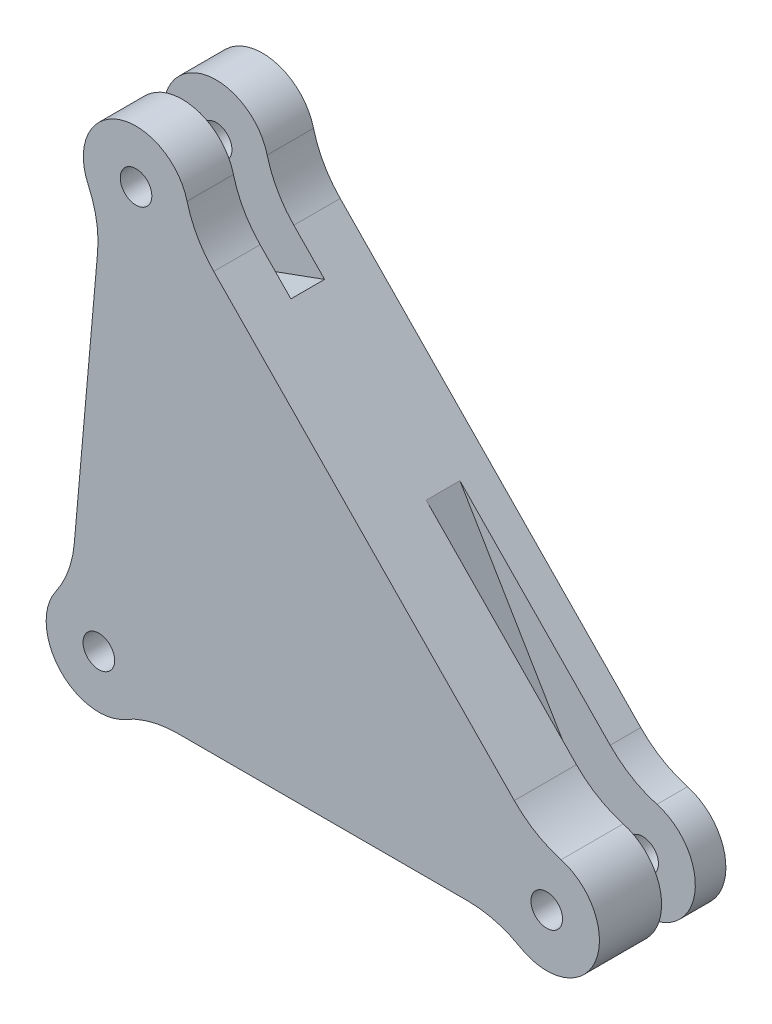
ISO-10303-21;
HEADER;
FILE_DESCRIPTION(('STEP AP214'),'2;1');
FILE_NAME('part.step','',(''),(''),'','','');
FILE_SCHEMA(('AUTOMOTIVE_DESIGN { 1 0 10303 214 1 1 1 1 }'));
ENDSEC;
DATA;
#1=APPLICATION_CONTEXT('core data for automotive mechanical design processes');
#2=APPLICATION_PROTOCOL_DEFINITION('international standard','automotive_design',2000,#1);
#3=PRODUCT_CONTEXT('',#1,'mechanical');
#4=PRODUCT('Part','Part','',(#3));
#5=PRODUCT_RELATED_PRODUCT_CATEGORY('part','',(#4));
#6=PRODUCT_DEFINITION_FORMATION('','',#4);
#7=PRODUCT_DEFINITION_CONTEXT('part definition',#1,'design');
#8=PRODUCT_DEFINITION('design','',#6,#7);
#9=PRODUCT_DEFINITION_SHAPE('','',#8);
#10=(LENGTH_UNIT() NAMED_UNIT(*) SI_UNIT(.MILLI.,.METRE.));
#11=(NAMED_UNIT(*) PLANE_ANGLE_UNIT() SI_UNIT($,.RADIAN.));
#12=(NAMED_UNIT(*) SI_UNIT($,.STERADIAN.) SOLID_ANGLE_UNIT());
#13=UNCERTAINTY_MEASURE_WITH_UNIT(LENGTH_MEASURE(1.E-05),#10,'distance_accuracy_value','');
#14=(GEOMETRIC_REPRESENTATION_CONTEXT(3) GLOBAL_UNCERTAINTY_ASSIGNED_CONTEXT((#13)) GLOBAL_UNIT_ASSIGNED_CONTEXT((#10,
#11,#12)) REPRESENTATION_CONTEXT('',''));
#15=CARTESIAN_POINT('',(0.,0.,0.));
#16=DIRECTION('',(0.,0.,1.));
#17=DIRECTION('',(1.,0.,0.));
#18=AXIS2_PLACEMENT_3D('',#15,#16,#17);
#19=CARTESIAN_POINT('',(-42.5,0.,12.));
#20=DIRECTION('',(0.,0.,-1.));
#21=DIRECTION('',(-1.,0.,0.));
#22=AXIS2_PLACEMENT_3D('',#19,#20,#21);
#23=CYLINDRICAL_SURFACE('',#22,5.);
#24=DIRECTION('',(0.,0.,-1.));
#25=VECTOR('',#24,1.);
#26=CARTESIAN_POINT('',(-46.5969828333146,2.86613531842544,12.));
#27=LINE('',#26,#25);
#28=CARTESIAN_POINT('',(-46.5969828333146,2.86613531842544,12.));
#29=VERTEX_POINT('',#28);
#30=CARTESIAN_POINT('',(-46.5969828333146,2.86613531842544,10.3));
#31=VERTEX_POINT('',#30);
#32=EDGE_CURVE('E413',#29,#31,#27,.T.);
#33=ORIENTED_EDGE('',*,*,#32,.T.);
#34=CARTESIAN_POINT('',(-42.5,0.,10.3));
#35=DIRECTION('',(0.,0.,-1.));
#36=DIRECTION('',(-1.,0.,0.));
#37=AXIS2_PLACEMENT_3D('',#34,#35,#36);
#38=CIRCLE('',#37,5.);
#39=CARTESIAN_POINT('',(-40.0055617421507,-4.33333333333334,10.3));
#40=VERTEX_POINT('',#39);
#41=EDGE_CURVE('E331',#31,#40,#38,.F.);
#42=ORIENTED_EDGE('',*,*,#41,.T.);
#43=DIRECTION('',(0.,0.,-1.));
#44=VECTOR('',#43,1.);
#45=CARTESIAN_POINT('',(-40.0055617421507,-4.33333333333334,12.));
#46=LINE('',#45,#44);
#47=CARTESIAN_POINT('',(-40.0055617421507,-4.33333333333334,12.));
#48=VERTEX_POINT('',#47);
#49=EDGE_CURVE('E415',#40,#48,#46,.F.);
#50=ORIENTED_EDGE('',*,*,#49,.T.);
#51=CARTESIAN_POINT('',(-42.5,0.,12.));
#52=DIRECTION('',(0.,0.,1.));
#53=DIRECTION('',(1.,0.,0.));
#54=AXIS2_PLACEMENT_3D('',#51,#52,#53);
#55=CIRCLE('',#54,5.);
#56=EDGE_CURVE('E496',#29,#48,#55,.T.);
#57=ORIENTED_EDGE('',*,*,#56,.F.);
#58=EDGE_LOOP('',(#33,#42,#50,#57));
#59=FACE_BOUND('',#58,.T.);
#60=ADVANCED_FACE('F35',(#59),#23,.T.);
#61=CARTESIAN_POINT('',(0.,-3.00000000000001,12.));
#62=DIRECTION('',(0.,1.,0.));
#63=DIRECTION('',(0.,0.,1.));
#64=AXIS2_PLACEMENT_3D('',#61,#62,#63);
#65=PLANE('',#64);
#66=DIRECTION('',(1.,0.,0.));
#67=VECTOR('',#66,1.);
#68=CARTESIAN_POINT('',(0.,-3.00000000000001,0.));
#69=LINE('',#68,#67);
#70=CARTESIAN_POINT('',(-35.0166852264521,-3.00000000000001,0.));
#71=VERTEX_POINT('',#70);
#72=CARTESIAN_POINT('',(-7.48331477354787,-3.00000000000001,0.));
#73=VERTEX_POINT('',#72);
#74=EDGE_CURVE('E403',#71,#73,#69,.T.);
#75=ORIENTED_EDGE('',*,*,#74,.T.);
#76=DIRECTION('',(0.,0.,1.));
#77=VECTOR('',#76,1.);
#78=CARTESIAN_POINT('',(-7.48331477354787,-3.00000000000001,2.9));
#79=LINE('',#78,#77);
#80=CARTESIAN_POINT('',(-7.48331477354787,-3.00000000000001,2.9));
#81=VERTEX_POINT('',#80);
#82=EDGE_CURVE('E521',#73,#81,#79,.T.);
#83=ORIENTED_EDGE('',*,*,#82,.T.);
#84=DIRECTION('',(1.,0.,0.));
#85=VECTOR('',#84,1.);
#86=CARTESIAN_POINT('',(0.,-3.00000000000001,2.9));
#87=LINE('',#86,#85);
#88=CARTESIAN_POINT('',(-21.25,-3.00000000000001,2.9));
#89=VERTEX_POINT('',#88);
#90=EDGE_CURVE('E741',#89,#81,#87,.T.);
#91=ORIENTED_EDGE('',*,*,#90,.F.);
#92=DIRECTION('',(1.,0.,0.));
#93=VECTOR('',#92,1.);
#94=CARTESIAN_POINT('',(-38.5,-3.00000000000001,2.9));
#95=LINE('',#94,#93);
#96=CARTESIAN_POINT('',(-35.0166852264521,-3.00000000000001,2.9));
#97=VERTEX_POINT('',#96);
#98=EDGE_CURVE('E577',#97,#89,#95,.T.);
#99=ORIENTED_EDGE('',*,*,#98,.F.);
#100=DIRECTION('',(0.,0.,1.));
#101=VECTOR('',#100,1.);
#102=CARTESIAN_POINT('',(-35.0166852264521,-3.00000000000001,0.));
#103=LINE('',#102,#101);
#104=EDGE_CURVE('E519',#97,#71,#103,.F.);
#105=ORIENTED_EDGE('',*,*,#104,.T.);
#106=EDGE_LOOP('',(#75,#83,#91,#99,#105));
#107=FACE_BOUND('',#106,.T.);
#108=ADVANCED_FACE('F369',(#107),#65,.F.);
#109=CARTESIAN_POINT('',(2.14707820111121,2.09524585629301,12.));
#110=DIRECTION('',(-0.715692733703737,-0.698415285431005,0.));
#111=DIRECTION('',(0.698415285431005,-0.715692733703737,0.));
#112=AXIS2_PLACEMENT_3D('',#109,#110,#111);
#113=PLANE('',#112);
#114=DIRECTION('',(-0.698415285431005,0.715692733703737,0.));
#115=VECTOR('',#114,1.);
#116=CARTESIAN_POINT('',(2.14707820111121,2.09524585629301,0.));
#117=LINE('',#116,#115);
#118=CARTESIAN_POINT('',(-3.07938322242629,7.45099986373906,0.));
#119=VERTEX_POINT('',#118);
#120=CARTESIAN_POINT('',(-31.5980333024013,36.6751463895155,0.));
#121=VERTEX_POINT('',#120);
#122=EDGE_CURVE('E659',#119,#121,#117,.T.);
#123=ORIENTED_EDGE('',*,*,#122,.T.);
#124=DIRECTION('',(0.,0.,1.));
#125=VECTOR('',#124,1.);
#126=CARTESIAN_POINT('',(-31.5980333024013,36.6751463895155,4.4));
#127=LINE('',#126,#125);
#128=CARTESIAN_POINT('',(-31.5980333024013,36.6751463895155,4.4));
#129=VERTEX_POINT('',#128);
#130=EDGE_CURVE('E501',#121,#129,#127,.T.);
#131=ORIENTED_EDGE('',*,*,#130,.T.);
#132=DIRECTION('',(-0.698415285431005,0.715692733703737,0.));
#133=VECTOR('',#132,1.);
#134=CARTESIAN_POINT('',(2.14707820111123,2.09524585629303,4.4));
#135=LINE('',#134,#133);
#136=CARTESIAN_POINT('',(-28.6775186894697,33.6823838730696,4.4));
#137=VERTEX_POINT('',#136);
#138=EDGE_CURVE('E607',#137,#129,#135,.T.);
#139=ORIENTED_EDGE('',*,*,#138,.F.);
#140=DIRECTION('',(0.,0.,-1.));
#141=VECTOR('',#140,1.);
#142=CARTESIAN_POINT('',(-28.6775186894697,33.6823838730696,7.6));
#143=LINE('',#142,#141);
#144=CARTESIAN_POINT('',(-28.6775186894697,33.6823838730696,7.6));
#145=VERTEX_POINT('',#144);
#146=EDGE_CURVE('E628',#145,#137,#143,.T.);
#147=ORIENTED_EDGE('',*,*,#146,.F.);
#148=DIRECTION('',(-0.698415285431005,0.715692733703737,0.));
#149=VECTOR('',#148,1.);
#150=CARTESIAN_POINT('',(2.14707820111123,2.09524585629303,7.6));
#151=LINE('',#150,#149);
#152=CARTESIAN_POINT('',(-31.5980333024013,36.6751463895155,7.6));
#153=VERTEX_POINT('',#152);
#154=EDGE_CURVE('E620',#145,#153,#151,.T.);
#155=ORIENTED_EDGE('',*,*,#154,.T.);
#156=DIRECTION('',(0.,0.,1.));
#157=VECTOR('',#156,1.);
#158=CARTESIAN_POINT('',(-31.5980333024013,36.6751463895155,12.));
#159=LINE('',#158,#157);
#160=CARTESIAN_POINT('',(-31.5980333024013,36.6751463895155,12.));
#161=VERTEX_POINT('',#160);
#162=EDGE_CURVE('E506',#153,#161,#159,.T.);
#163=ORIENTED_EDGE('',*,*,#162,.T.);
#164=DIRECTION('',(-0.698415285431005,0.715692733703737,0.));
#165=VECTOR('',#164,1.);
#166=CARTESIAN_POINT('',(2.14707820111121,2.09524585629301,12.));
#167=LINE('',#166,#165);
#168=CARTESIAN_POINT('',(-3.07938322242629,7.45099986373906,12.));
#169=VERTEX_POINT('',#168);
#170=EDGE_CURVE('E644',#169,#161,#167,.T.);
#171=ORIENTED_EDGE('',*,*,#170,.F.);
#172=DIRECTION('',(0.,0.,1.));
#173=VECTOR('',#172,1.);
#174=CARTESIAN_POINT('',(-3.07938322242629,7.45099986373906,6.1));
#175=LINE('',#174,#173);
#176=CARTESIAN_POINT('',(-3.07938322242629,7.45099986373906,6.1));
#177=VERTEX_POINT('',#176);
#178=EDGE_CURVE('E678',#169,#177,#175,.F.);
#179=ORIENTED_EDGE('',*,*,#178,.T.);
#180=DIRECTION('',(0.698415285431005,-0.715692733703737,0.));
#181=VECTOR('',#180,1.);
#182=CARTESIAN_POINT('',(2.14707820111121,2.09524585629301,6.1));
#183=LINE('',#182,#181);
#184=CARTESIAN_POINT('',(-17.3387082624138,22.0630731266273,6.1));
#185=VERTEX_POINT('',#184);
#186=EDGE_CURVE('E551',#185,#177,#183,.T.);
#187=ORIENTED_EDGE('',*,*,#186,.F.);
#188=DIRECTION('',(0.,0.,1.));
#189=VECTOR('',#188,1.);
#190=CARTESIAN_POINT('',(-17.3387082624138,22.0630731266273,2.9));
#191=LINE('',#190,#189);
#192=CARTESIAN_POINT('',(-17.3387082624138,22.0630731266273,2.9));
#193=VERTEX_POINT('',#192);
#194=EDGE_CURVE('E561',#193,#185,#191,.T.);
#195=ORIENTED_EDGE('',*,*,#194,.F.);
#196=DIRECTION('',(0.698415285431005,-0.715692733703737,0.));
#197=VECTOR('',#196,1.);
#198=CARTESIAN_POINT('',(2.14707820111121,2.09524585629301,2.9));
#199=LINE('',#198,#197);
#200=CARTESIAN_POINT('',(-3.07938322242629,7.45099986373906,2.9));
#201=VERTEX_POINT('',#200);
#202=EDGE_CURVE('E722',#193,#201,#199,.T.);
#203=ORIENTED_EDGE('',*,*,#202,.T.);
#204=DIRECTION('',(0.,0.,1.));
#205=VECTOR('',#204,1.);
#206=CARTESIAN_POINT('',(-3.07938322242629,7.45099986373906,0.));
#207=LINE('',#206,#205);
#208=EDGE_CURVE('E675',#201,#119,#207,.F.);
#209=ORIENTED_EDGE('',*,*,#208,.T.);
#210=EDGE_LOOP('',(#123,#131,#139,#147,#155,#163,#171,#179,#187,#195,#203,#209));
#211=FACE_BOUND('',#210,.T.);
#212=ADVANCED_FACE('F376',(#211),#113,.F.);
#213=CARTESIAN_POINT('',(0.,0.,12.));
#214=DIRECTION('',(0.,0.,-1.));
#215=DIRECTION('',(-1.,0.,0.));
#216=AXIS2_PLACEMENT_3D('',#213,#214,#215);
#217=CYLINDRICAL_SURFACE('',#216,1.5);
#218=CARTESIAN_POINT('',(0.,0.,0.));
#219=DIRECTION('',(0.,0.,1.));
#220=DIRECTION('',(1.,0.,0.));
#221=AXIS2_PLACEMENT_3D('',#218,#219,#220);
#222=CIRCLE('',#221,1.5);
#223=CARTESIAN_POINT('',(1.5,0.,0.));
#224=VERTEX_POINT('',#223);
#225=EDGE_CURVE('E656',#224,#224,#222,.T.);
#226=ORIENTED_EDGE('',*,*,#225,.F.);
#227=EDGE_LOOP('',(#226));
#228=FACE_BOUND('',#227,.T.);
#229=CARTESIAN_POINT('',(0.,0.,2.9));
#230=DIRECTION('',(0.,0.,1.));
#231=DIRECTION('',(1.,0.,0.));
#232=AXIS2_PLACEMENT_3D('',#229,#230,#231);
#233=CIRCLE('',#232,1.5);
#234=CARTESIAN_POINT('',(1.5,0.,2.9));
#235=VERTEX_POINT('',#234);
#236=EDGE_CURVE('E565',#235,#235,#233,.T.);
#237=ORIENTED_EDGE('',*,*,#236,.T.);
#238=EDGE_LOOP('',(#237));
#239=FACE_BOUND('',#238,.T.);
#240=ADVANCED_FACE('F768',(#228,#239),#217,.F.);
#241=CARTESIAN_POINT('',(0.,0.,12.));
#242=DIRECTION('',(0.,0.,-1.));
#243=DIRECTION('',(-1.,0.,0.));
#244=AXIS2_PLACEMENT_3D('',#241,#242,#243);
#245=CYLINDRICAL_SURFACE('',#244,5.);
#246=CARTESIAN_POINT('',(0.,0.,0.));
#247=DIRECTION('',(0.,0.,1.));
#248=DIRECTION('',(1.,0.,0.));
#249=AXIS2_PLACEMENT_3D('',#246,#247,#248);
#250=CIRCLE('',#249,5.);
#251=CARTESIAN_POINT('',(-2.49443825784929,-4.33333333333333,0.));
#252=VERTEX_POINT('',#251);
#253=CARTESIAN_POINT('',(1.35918137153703,4.81171757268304,0.));
#254=VERTEX_POINT('',#253);
#255=EDGE_CURVE('E638',#252,#254,#250,.T.);
#256=ORIENTED_EDGE('',*,*,#255,.T.);
#257=DIRECTION('',(0.,0.,-1.));
#258=VECTOR('',#257,1.);
#259=CARTESIAN_POINT('',(1.35918137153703,4.81171757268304,12.));
#260=LINE('',#259,#258);
#261=CARTESIAN_POINT('',(1.35918137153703,4.81171757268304,2.9));
#262=VERTEX_POINT('',#261);
#263=EDGE_CURVE('E517',#254,#262,#260,.F.);
#264=ORIENTED_EDGE('',*,*,#263,.T.);
#265=CARTESIAN_POINT('',(0.,0.,2.9));
#266=DIRECTION('',(0.,0.,1.));
#267=DIRECTION('',(1.,0.,0.));
#268=AXIS2_PLACEMENT_3D('',#265,#266,#267);
#269=CIRCLE('',#268,5.);
#270=CARTESIAN_POINT('',(-2.49443825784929,-4.33333333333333,2.9));
#271=VERTEX_POINT('',#270);
#272=EDGE_CURVE('E732',#271,#262,#269,.T.);
#273=ORIENTED_EDGE('',*,*,#272,.F.);
#274=DIRECTION('',(0.,0.,-1.));
#275=VECTOR('',#274,1.);
#276=CARTESIAN_POINT('',(-2.49443825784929,-4.33333333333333,12.));
#277=LINE('',#276,#275);
#278=EDGE_CURVE('E514',#271,#252,#277,.T.);
#279=ORIENTED_EDGE('',*,*,#278,.T.);
#280=EDGE_LOOP('',(#256,#264,#273,#279));
#281=FACE_BOUND('',#280,.T.);
#282=ADVANCED_FACE('F390',(#281),#245,.T.);
#283=CARTESIAN_POINT('',(-45.1591642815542,3.9899388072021,12.));
#284=DIRECTION('',(0.996119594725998,-0.0880099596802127,0.));
#285=DIRECTION('',(0.0880099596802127,0.996119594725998,0.));
#286=AXIS2_PLACEMENT_3D('',#283,#284,#285);
#287=PLANE('',#286);
#288=DIRECTION('',(-0.0880099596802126,-0.996119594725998,0.));
#289=VECTOR('',#288,1.);
#290=CARTESIAN_POINT('',(-43.724145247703,20.2318571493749,6.1));
#291=LINE('',#290,#289);
#292=CARTESIAN_POINT('',(-43.724145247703,20.2318571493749,6.1));
#293=VERTEX_POINT('',#292);
#294=CARTESIAN_POINT('',(-44.8297525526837,7.71830635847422,6.1));
#295=VERTEX_POINT('',#294);
#296=EDGE_CURVE('E569',#293,#295,#291,.T.);
#297=ORIENTED_EDGE('',*,*,#296,.T.);
#298=DIRECTION('',(0.,0.,1.));
#299=VECTOR('',#298,1.);
#300=CARTESIAN_POINT('',(-44.8297525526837,7.71830635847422,12.));
#301=LINE('',#300,#299);
#302=CARTESIAN_POINT('',(-44.8297525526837,7.71830635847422,12.));
#303=VERTEX_POINT('',#302);
#304=EDGE_CURVE('E430',#295,#303,#301,.T.);
#305=ORIENTED_EDGE('',*,*,#304,.T.);
#306=DIRECTION('',(-0.0880099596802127,-0.996119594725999,0.));
#307=VECTOR('',#306,1.);
#308=CARTESIAN_POINT('',(-45.1591642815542,3.9899388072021,12.));
#309=LINE('',#308,#307);
#310=CARTESIAN_POINT('',(-42.6185379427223,32.7454079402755,12.));
#311=VERTEX_POINT('',#310);
#312=EDGE_CURVE('E486',#311,#303,#309,.T.);
#313=ORIENTED_EDGE('',*,*,#312,.F.);
#314=DIRECTION('',(0.,0.,1.));
#315=VECTOR('',#314,1.);
#316=CARTESIAN_POINT('',(-42.6185379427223,32.7454079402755,7.6));
#317=LINE('',#316,#315);
#318=CARTESIAN_POINT('',(-42.6185379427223,32.7454079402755,7.6));
#319=VERTEX_POINT('',#318);
#320=EDGE_CURVE('E422',#311,#319,#317,.F.);
#321=ORIENTED_EDGE('',*,*,#320,.T.);
#322=DIRECTION('',(0.0880099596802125,0.996119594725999,0.));
#323=VECTOR('',#322,1.);
#324=CARTESIAN_POINT('',(-45.1591642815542,3.98993880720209,7.6));
#325=LINE('',#324,#323);
#326=CARTESIAN_POINT('',(-42.9962110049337,28.4708060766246,7.6));
#327=VERTEX_POINT('',#326);
#328=EDGE_CURVE('E616',#327,#319,#325,.T.);
#329=ORIENTED_EDGE('',*,*,#328,.F.);
#330=DIRECTION('',(0.,0.,-1.));
#331=VECTOR('',#330,1.);
#332=CARTESIAN_POINT('',(-42.9962110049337,28.4708060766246,7.6));
#333=LINE('',#332,#331);
#334=CARTESIAN_POINT('',(-42.9962110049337,28.4708060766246,4.4));
#335=VERTEX_POINT('',#334);
#336=EDGE_CURVE('E630',#327,#335,#333,.T.);
#337=ORIENTED_EDGE('',*,*,#336,.T.);
#338=DIRECTION('',(0.0880099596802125,0.996119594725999,0.));
#339=VECTOR('',#338,1.);
#340=CARTESIAN_POINT('',(-45.1591642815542,3.98993880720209,4.4));
#341=LINE('',#340,#339);
#342=CARTESIAN_POINT('',(-42.6185379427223,32.7454079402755,4.4));
#343=VERTEX_POINT('',#342);
#344=EDGE_CURVE('E597',#335,#343,#341,.T.);
#345=ORIENTED_EDGE('',*,*,#344,.T.);
#346=DIRECTION('',(0.,0.,1.));
#347=VECTOR('',#346,1.);
#348=CARTESIAN_POINT('',(-42.6185379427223,32.7454079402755,0.));
#349=LINE('',#348,#347);
#350=CARTESIAN_POINT('',(-42.6185379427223,32.7454079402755,0.));
#351=VERTEX_POINT('',#350);
#352=EDGE_CURVE('E425',#343,#351,#349,.F.);
#353=ORIENTED_EDGE('',*,*,#352,.T.);
#354=DIRECTION('',(-0.0880099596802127,-0.996119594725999,0.));
#355=VECTOR('',#354,1.);
#356=CARTESIAN_POINT('',(-45.1591642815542,3.9899388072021,0.));
#357=LINE('',#356,#355);
#358=CARTESIAN_POINT('',(-44.8297525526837,7.71830635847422,0.));
#359=VERTEX_POINT('',#358);
#360=EDGE_CURVE('E404',#351,#359,#357,.T.);
#361=ORIENTED_EDGE('',*,*,#360,.T.);
#362=DIRECTION('',(0.,0.,1.));
#363=VECTOR('',#362,1.);
#364=CARTESIAN_POINT('',(-44.8297525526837,7.71830635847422,2.9));
#365=LINE('',#364,#363);
#366=CARTESIAN_POINT('',(-44.8297525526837,7.71830635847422,2.9));
#367=VERTEX_POINT('',#366);
#368=EDGE_CURVE('E428',#359,#367,#365,.T.);
#369=ORIENTED_EDGE('',*,*,#368,.T.);
#370=DIRECTION('',(-0.0880099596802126,-0.996119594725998,0.));
#371=VECTOR('',#370,1.);
#372=CARTESIAN_POINT('',(-43.724145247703,20.2318571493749,2.9));
#373=LINE('',#372,#371);
#374=CARTESIAN_POINT('',(-43.724145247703,20.2318571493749,2.9));
#375=VERTEX_POINT('',#374);
#376=EDGE_CURVE('E571',#375,#367,#373,.T.);
#377=ORIENTED_EDGE('',*,*,#376,.F.);
#378=DIRECTION('',(0.,0.,1.));
#379=VECTOR('',#378,1.);
#380=CARTESIAN_POINT('',(-43.724145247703,20.2318571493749,2.9));
#381=LINE('',#380,#379);
#382=EDGE_CURVE('E594',#375,#293,#381,.T.);
#383=ORIENTED_EDGE('',*,*,#382,.T.);
#384=EDGE_LOOP('',(#297,#305,#313,#321,#329,#337,#345,#353,#361,#369,#377,#383));
#385=FACE_BOUND('',#384,.T.);
#386=ADVANCED_FACE('F382',(#385),#287,.F.);
#387=CARTESIAN_POINT('',(-42.5,0.,0.));
#388=DIRECTION('',(0.,0.,1.));
#389=DIRECTION('',(1.,0.,0.));
#390=AXIS2_PLACEMENT_3D('',#387,#388,#389);
#391=CIRCLE('',#390,5.);
#392=CARTESIAN_POINT('',(-46.5969828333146,2.86613531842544,0.));
#393=VERTEX_POINT('',#392);
#394=CARTESIAN_POINT('',(-40.0055617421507,-4.33333333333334,0.));
#395=VERTEX_POINT('',#394);
#396=EDGE_CURVE('E395',#393,#395,#391,.T.);
#397=ORIENTED_EDGE('',*,*,#396,.T.);
#398=DIRECTION('',(0.,0.,-1.));
#399=VECTOR('',#398,1.);
#400=CARTESIAN_POINT('',(-40.0055617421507,-4.33333333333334,12.));
#401=LINE('',#400,#399);
#402=CARTESIAN_POINT('',(-40.0055617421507,-4.33333333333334,2.9));
#403=VERTEX_POINT('',#402);
#404=EDGE_CURVE('E398',#395,#403,#401,.F.);
#405=ORIENTED_EDGE('',*,*,#404,.T.);
#406=CARTESIAN_POINT('',(-42.5,0.,2.9));
#407=DIRECTION('',(0.,0.,1.));
#408=DIRECTION('',(1.,0.,0.));
#409=AXIS2_PLACEMENT_3D('',#406,#407,#408);
#410=CIRCLE('',#409,5.);
#411=CARTESIAN_POINT('',(-46.5969828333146,2.86613531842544,2.9));
#412=VERTEX_POINT('',#411);
#413=EDGE_CURVE('E574',#412,#403,#410,.T.);
#414=ORIENTED_EDGE('',*,*,#413,.F.);
#415=DIRECTION('',(0.,0.,-1.));
#416=VECTOR('',#415,1.);
#417=CARTESIAN_POINT('',(-46.5969828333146,2.86613531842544,12.));
#418=LINE('',#417,#416);
#419=EDGE_CURVE('E401',#412,#393,#418,.T.);
#420=ORIENTED_EDGE('',*,*,#419,.T.);
#421=EDGE_LOOP('',(#397,#405,#414,#420));
#422=FACE_BOUND('',#421,.T.);
#423=ADVANCED_FACE('F372',(#422),#23,.T.);
#424=DIRECTION('',(1.,0.,0.));
#425=VECTOR('',#424,1.);
#426=CARTESIAN_POINT('',(0.,-3.00000000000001,6.1));
#427=LINE('',#426,#425);
#428=CARTESIAN_POINT('',(-21.25,-3.00000000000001,6.1));
#429=VERTEX_POINT('',#428);
#430=CARTESIAN_POINT('',(-7.48331477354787,-3.00000000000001,6.1));
#431=VERTEX_POINT('',#430);
#432=EDGE_CURVE('E531',#429,#431,#427,.T.);
#433=ORIENTED_EDGE('',*,*,#432,.T.);
#434=DIRECTION('',(0.,0.,1.));
#435=VECTOR('',#434,1.);
#436=CARTESIAN_POINT('',(-7.48331477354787,-3.00000000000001,12.));
#437=LINE('',#436,#435);
#438=CARTESIAN_POINT('',(-7.48331477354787,-3.00000000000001,12.));
#439=VERTEX_POINT('',#438);
#440=EDGE_CURVE('E417',#431,#439,#437,.T.);
#441=ORIENTED_EDGE('',*,*,#440,.T.);
#442=DIRECTION('',(1.,0.,0.));
#443=VECTOR('',#442,1.);
#444=CARTESIAN_POINT('',(0.,-3.00000000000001,12.));
#445=LINE('',#444,#443);
#446=CARTESIAN_POINT('',(-35.0166852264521,-3.00000000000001,12.));
#447=VERTEX_POINT('',#446);
#448=EDGE_CURVE('E528',#447,#439,#445,.T.);
#449=ORIENTED_EDGE('',*,*,#448,.F.);
#450=DIRECTION('',(0.,0.,1.));
#451=VECTOR('',#450,1.);
#452=CARTESIAN_POINT('',(-35.0166852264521,-3.00000000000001,6.1));
#453=LINE('',#452,#451);
#454=CARTESIAN_POINT('',(-35.0166852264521,-3.00000000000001,6.1));
#455=VERTEX_POINT('',#454);
#456=EDGE_CURVE('E523',#447,#455,#453,.F.);
#457=ORIENTED_EDGE('',*,*,#456,.T.);
#458=DIRECTION('',(1.,0.,0.));
#459=VECTOR('',#458,1.);
#460=CARTESIAN_POINT('',(-38.5,-3.00000000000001,6.1));
#461=LINE('',#460,#459);
#462=EDGE_CURVE('E587',#455,#429,#461,.T.);
#463=ORIENTED_EDGE('',*,*,#462,.T.);
#464=EDGE_LOOP('',(#433,#441,#449,#457,#463));
#465=FACE_BOUND('',#464,.T.);
#466=ADVANCED_FACE('F379',(#465),#65,.F.);
#467=CARTESIAN_POINT('',(-42.5,0.,12.));
#468=DIRECTION('',(0.,0.,-1.));
#469=DIRECTION('',(-1.,0.,0.));
#470=AXIS2_PLACEMENT_3D('',#467,#468,#469);
#471=CYLINDRICAL_SURFACE('',#470,1.5);
#472=CARTESIAN_POINT('',(-42.5,0.,0.));
#473=DIRECTION('',(0.,0.,1.));
#474=DIRECTION('',(1.,0.,0.));
#475=AXIS2_PLACEMENT_3D('',#472,#473,#474);
#476=CIRCLE('',#475,1.5);
#477=CARTESIAN_POINT('',(-41.,0.,0.));
#478=VERTEX_POINT('',#477);
#479=EDGE_CURVE('E653',#478,#478,#476,.T.);
#480=ORIENTED_EDGE('',*,*,#479,.F.);
#481=EDGE_LOOP('',(#480));
#482=FACE_BOUND('',#481,.T.);
#483=CARTESIAN_POINT('',(-42.5,0.,2.9));
#484=DIRECTION('',(0.,0.,1.));
#485=DIRECTION('',(1.,0.,0.));
#486=AXIS2_PLACEMENT_3D('',#483,#484,#485);
#487=CIRCLE('',#486,1.5);
#488=CARTESIAN_POINT('',(-41.,0.,2.9));
#489=VERTEX_POINT('',#488);
#490=EDGE_CURVE('E566',#489,#489,#487,.T.);
#491=ORIENTED_EDGE('',*,*,#490,.T.);
#492=EDGE_LOOP('',(#491));
#493=FACE_BOUND('',#492,.T.);
#494=ADVANCED_FACE('F388',(#482,#493),#471,.F.);
#495=CARTESIAN_POINT('',(-38.9715729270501,39.9356545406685,12.));
#496=DIRECTION('',(0.,0.,-1.));
#497=DIRECTION('',(-1.,0.,0.));
#498=AXIS2_PLACEMENT_3D('',#495,#496,#497);
#499=CYLINDRICAL_SURFACE('',#498,5.00000000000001);
#500=CARTESIAN_POINT('',(-38.9715729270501,39.9356545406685,4.4));
#501=DIRECTION('',(0.,0.,1.));
#502=DIRECTION('',(1.,0.,0.));
#503=AXIS2_PLACEMENT_3D('',#500,#501,#502);
#504=CIRCLE('',#503,5.);
#505=CARTESIAN_POINT('',(-34.1280839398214,41.1768694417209,4.4));
#506=VERTEX_POINT('',#505);
#507=CARTESIAN_POINT('',(-43.5076265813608,37.8322722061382,4.4));
#508=VERTEX_POINT('',#507);
#509=EDGE_CURVE('E610',#506,#508,#504,.T.);
#510=ORIENTED_EDGE('',*,*,#509,.F.);
#511=DIRECTION('',(0.,0.,-1.));
#512=VECTOR('',#511,1.);
#513=CARTESIAN_POINT('',(-34.1280839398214,41.1768694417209,12.));
#514=LINE('',#513,#512);
#515=CARTESIAN_POINT('',(-34.1280839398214,41.1768694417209,0.));
#516=VERTEX_POINT('',#515);
#517=EDGE_CURVE('E672',#506,#516,#514,.T.);
#518=ORIENTED_EDGE('',*,*,#517,.T.);
#519=CARTESIAN_POINT('',(-38.9715729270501,39.9356545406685,0.));
#520=DIRECTION('',(0.,0.,1.));
#521=DIRECTION('',(1.,0.,0.));
#522=AXIS2_PLACEMENT_3D('',#519,#520,#521);
#523=CIRCLE('',#522,5.00000000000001);
#524=CARTESIAN_POINT('',(-43.5076265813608,37.8322722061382,0.));
#525=VERTEX_POINT('',#524);
#526=EDGE_CURVE('E662',#516,#525,#523,.T.);
#527=ORIENTED_EDGE('',*,*,#526,.T.);
#528=DIRECTION('',(0.,0.,-1.));
#529=VECTOR('',#528,1.);
#530=CARTESIAN_POINT('',(-43.5076265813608,37.8322722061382,12.));
#531=LINE('',#530,#529);
#532=EDGE_CURVE('E650',#525,#508,#531,.F.);
#533=ORIENTED_EDGE('',*,*,#532,.T.);
#534=EDGE_LOOP('',(#510,#518,#527,#533));
#535=FACE_BOUND('',#534,.T.);
#536=ADVANCED_FACE('F714',(#535),#499,.T.);
#537=CARTESIAN_POINT('',(-38.9715729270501,39.9356545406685,12.));
#538=DIRECTION('',(0.,0.,-1.));
#539=DIRECTION('',(-1.,0.,0.));
#540=AXIS2_PLACEMENT_3D('',#537,#538,#539);
#541=CYLINDRICAL_SURFACE('',#540,1.50000000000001);
#542=CARTESIAN_POINT('',(-38.9715729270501,39.9356545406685,0.));
#543=DIRECTION('',(0.,0.,1.));
#544=DIRECTION('',(1.,0.,0.));
#545=AXIS2_PLACEMENT_3D('',#542,#543,#544);
#546=CIRCLE('',#545,1.50000000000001);
#547=CARTESIAN_POINT('',(-37.47157292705,39.9356545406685,0.));
#548=VERTEX_POINT('',#547);
#549=EDGE_CURVE('E633',#548,#548,#546,.T.);
#550=ORIENTED_EDGE('',*,*,#549,.F.);
#551=EDGE_LOOP('',(#550));
#552=FACE_BOUND('',#551,.T.);
#553=CARTESIAN_POINT('',(-38.9715729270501,39.9356545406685,4.4));
#554=DIRECTION('',(0.,0.,1.));
#555=DIRECTION('',(1.,0.,0.));
#556=AXIS2_PLACEMENT_3D('',#553,#554,#555);
#557=CIRCLE('',#556,1.5);
#558=CARTESIAN_POINT('',(-37.4715729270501,39.9356545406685,4.4));
#559=VERTEX_POINT('',#558);
#560=EDGE_CURVE('E613',#559,#559,#557,.T.);
#561=ORIENTED_EDGE('',*,*,#560,.T.);
#562=EDGE_LOOP('',(#561));
#563=FACE_BOUND('',#562,.T.);
#564=ADVANCED_FACE('F814',(#552,#563),#541,.F.);
#565=CARTESIAN_POINT('',(-38.9715729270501,39.9356545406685,12.));
#566=DIRECTION('',(0.,0.,1.));
#567=DIRECTION('',(1.,0.,0.));
#568=AXIS2_PLACEMENT_3D('',#565,#566,#567);
#569=CIRCLE('',#568,5.00000000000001);
#570=CARTESIAN_POINT('',(-34.1280839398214,41.1768694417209,12.));
#571=VERTEX_POINT('',#570);
#572=CARTESIAN_POINT('',(-43.5076265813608,37.8322722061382,12.));
#573=VERTEX_POINT('',#572);
#574=EDGE_CURVE('E489',#571,#573,#569,.T.);
#575=ORIENTED_EDGE('',*,*,#574,.F.);
#576=DIRECTION('',(0.,0.,-1.));
#577=VECTOR('',#576,1.);
#578=CARTESIAN_POINT('',(-34.1280839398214,41.1768694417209,12.));
#579=LINE('',#578,#577);
#580=CARTESIAN_POINT('',(-34.1280839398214,41.1768694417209,7.6));
#581=VERTEX_POINT('',#580);
#582=EDGE_CURVE('E500',#571,#581,#579,.T.);
#583=ORIENTED_EDGE('',*,*,#582,.T.);
#584=CARTESIAN_POINT('',(-38.9715729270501,39.9356545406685,7.6));
#585=DIRECTION('',(0.,0.,1.));
#586=DIRECTION('',(1.,0.,0.));
#587=AXIS2_PLACEMENT_3D('',#584,#585,#586);
#588=CIRCLE('',#587,5.);
#589=CARTESIAN_POINT('',(-43.5076265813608,37.8322722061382,7.6));
#590=VERTEX_POINT('',#589);
#591=EDGE_CURVE('E623',#581,#590,#588,.T.);
#592=ORIENTED_EDGE('',*,*,#591,.T.);
#593=DIRECTION('',(0.,0.,-1.));
#594=VECTOR('',#593,1.);
#595=CARTESIAN_POINT('',(-43.5076265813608,37.8322722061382,12.));
#596=LINE('',#595,#594);
#597=EDGE_CURVE('E498',#590,#573,#596,.F.);
#598=ORIENTED_EDGE('',*,*,#597,.T.);
#599=EDGE_LOOP('',(#575,#583,#592,#598));
#600=FACE_BOUND('',#599,.T.);
#601=ADVANCED_FACE('F691',(#600),#499,.T.);
#602=CARTESIAN_POINT('',(0.,0.,6.1));
#603=DIRECTION('',(0.,0.,1.));
#604=DIRECTION('',(1.,0.,0.));
#605=AXIS2_PLACEMENT_3D('',#602,#603,#604);
#606=CIRCLE('',#605,1.5);
#607=CARTESIAN_POINT('',(1.5,0.,6.1));
#608=VERTEX_POINT('',#607);
#609=EDGE_CURVE('E553',#608,#608,#606,.T.);
#610=ORIENTED_EDGE('',*,*,#609,.F.);
#611=EDGE_LOOP('',(#610));
#612=FACE_BOUND('',#611,.T.);
#613=CARTESIAN_POINT('',(0.,0.,12.));
#614=DIRECTION('',(0.,0.,1.));
#615=DIRECTION('',(1.,0.,0.));
#616=AXIS2_PLACEMENT_3D('',#613,#614,#615);
#617=CIRCLE('',#616,1.5);
#618=CARTESIAN_POINT('',(1.5,0.,12.));
#619=VERTEX_POINT('',#618);
#620=EDGE_CURVE('E641',#619,#619,#617,.T.);
#621=ORIENTED_EDGE('',*,*,#620,.T.);
#622=EDGE_LOOP('',(#621));
#623=FACE_BOUND('',#622,.T.);
#624=ADVANCED_FACE('F821',(#612,#623),#217,.F.);
#625=DIRECTION('',(0.,0.,1.));
#626=VECTOR('',#625,1.);
#627=CARTESIAN_POINT('',(-41.3686078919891,-0.984861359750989,6.3));
#628=LINE('',#627,#626);
#629=CARTESIAN_POINT('',(-41.3686078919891,-0.984861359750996,9.3));
#630=VERTEX_POINT('',#629);
#631=CARTESIAN_POINT('',(-41.3686078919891,-0.984861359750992,6.1));
#632=VERTEX_POINT('',#631);
#633=EDGE_CURVE('E280',#630,#632,#628,.F.);
#634=ORIENTED_EDGE('',*,*,#633,.F.);
#635=CARTESIAN_POINT('',(-42.5,0.,9.3));
#636=DIRECTION('',(0.,0.,-1.));
#637=DIRECTION('',(-1.,0.,0.));
#638=AXIS2_PLACEMENT_3D('',#635,#636,#637);
#639=CIRCLE('',#638,1.5);
#640=CARTESIAN_POINT('',(-43.3808434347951,1.21413131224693,9.3));
#641=VERTEX_POINT('',#640);
#642=EDGE_CURVE('E286',#630,#641,#639,.T.);
#643=ORIENTED_EDGE('',*,*,#642,.T.);
#644=DIRECTION('',(0.,0.,1.));
#645=VECTOR('',#644,1.);
#646=CARTESIAN_POINT('',(-43.3808434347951,1.21413131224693,6.3));
#647=LINE('',#646,#645);
#648=CARTESIAN_POINT('',(-43.3808434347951,1.21413131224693,6.1));
#649=VERTEX_POINT('',#648);
#650=EDGE_CURVE('E893',#649,#641,#647,.T.);
#651=ORIENTED_EDGE('',*,*,#650,.F.);
#652=CARTESIAN_POINT('',(-42.5,0.,6.1));
#653=DIRECTION('',(0.,0.,1.));
#654=DIRECTION('',(1.,0.,0.));
#655=AXIS2_PLACEMENT_3D('',#652,#653,#654);
#656=CIRCLE('',#655,1.5);
#657=EDGE_CURVE('E301',#632,#649,#656,.T.);
#658=ORIENTED_EDGE('',*,*,#657,.F.);
#659=EDGE_LOOP('',(#634,#643,#651,#658));
#660=FACE_BOUND('',#659,.T.);
#661=CARTESIAN_POINT('',(-42.5,0.,12.));
#662=DIRECTION('',(0.,0.,1.));
#663=DIRECTION('',(1.,0.,0.));
#664=AXIS2_PLACEMENT_3D('',#661,#662,#663);
#665=CIRCLE('',#664,1.5);
#666=CARTESIAN_POINT('',(-41.,0.,12.));
#667=VERTEX_POINT('',#666);
#668=EDGE_CURVE('E637',#667,#667,#665,.T.);
#669=ORIENTED_EDGE('',*,*,#668,.T.);
#670=EDGE_LOOP('',(#669));
#671=FACE_BOUND('',#670,.T.);
#672=ADVANCED_FACE('F298',(#660,#671),#471,.F.);
#673=CARTESIAN_POINT('',(-38.9715729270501,39.9356545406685,7.6));
#674=DIRECTION('',(0.,0.,1.));
#675=DIRECTION('',(1.,0.,0.));
#676=AXIS2_PLACEMENT_3D('',#673,#674,#675);
#677=CIRCLE('',#676,1.5);
#678=CARTESIAN_POINT('',(-37.4715729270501,39.9356545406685,7.6));
#679=VERTEX_POINT('',#678);
#680=EDGE_CURVE('E625',#679,#679,#677,.T.);
#681=ORIENTED_EDGE('',*,*,#680,.F.);
#682=EDGE_LOOP('',(#681));
#683=FACE_BOUND('',#682,.T.);
#684=CARTESIAN_POINT('',(-38.9715729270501,39.9356545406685,12.));
#685=DIRECTION('',(0.,0.,1.));
#686=DIRECTION('',(1.,0.,0.));
#687=AXIS2_PLACEMENT_3D('',#684,#685,#686);
#688=CIRCLE('',#687,1.50000000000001);
#689=CARTESIAN_POINT('',(-37.47157292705,39.9356545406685,12.));
#690=VERTEX_POINT('',#689);
#691=EDGE_CURVE('E634',#690,#690,#688,.T.);
#692=ORIENTED_EDGE('',*,*,#691,.T.);
#693=EDGE_LOOP('',(#692));
#694=FACE_BOUND('',#693,.T.);
#695=ADVANCED_FACE('F808',(#683,#694),#541,.F.);
#696=CARTESIAN_POINT('',(0.,0.,6.1));
#697=DIRECTION('',(0.,0.,1.));
#698=DIRECTION('',(1.,0.,0.));
#699=AXIS2_PLACEMENT_3D('',#696,#697,#698);
#700=CIRCLE('',#699,5.);
#701=CARTESIAN_POINT('',(-2.49443825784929,-4.33333333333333,6.1));
#702=VERTEX_POINT('',#701);
#703=CARTESIAN_POINT('',(1.35918137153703,4.81171757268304,6.1));
#704=VERTEX_POINT('',#703);
#705=EDGE_CURVE('E545',#702,#704,#700,.T.);
#706=ORIENTED_EDGE('',*,*,#705,.T.);
#707=DIRECTION('',(0.,0.,-1.));
#708=VECTOR('',#707,1.);
#709=CARTESIAN_POINT('',(1.35918137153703,4.81171757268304,12.));
#710=LINE('',#709,#708);
#711=CARTESIAN_POINT('',(1.35918137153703,4.81171757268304,12.));
#712=VERTEX_POINT('',#711);
#713=EDGE_CURVE('E512',#704,#712,#710,.F.);
#714=ORIENTED_EDGE('',*,*,#713,.T.);
#715=CARTESIAN_POINT('',(0.,0.,12.));
#716=DIRECTION('',(0.,0.,1.));
#717=DIRECTION('',(1.,0.,0.));
#718=AXIS2_PLACEMENT_3D('',#715,#716,#717);
#719=CIRCLE('',#718,5.);
#720=CARTESIAN_POINT('',(-2.49443825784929,-4.33333333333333,12.));
#721=VERTEX_POINT('',#720);
#722=EDGE_CURVE('E537',#721,#712,#719,.T.);
#723=ORIENTED_EDGE('',*,*,#722,.F.);
#724=DIRECTION('',(0.,0.,-1.));
#725=VECTOR('',#724,1.);
#726=CARTESIAN_POINT('',(-2.49443825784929,-4.33333333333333,12.));
#727=LINE('',#726,#725);
#728=EDGE_CURVE('E504',#721,#702,#727,.T.);
#729=ORIENTED_EDGE('',*,*,#728,.T.);
#730=EDGE_LOOP('',(#706,#714,#723,#729));
#731=FACE_BOUND('',#730,.T.);
#732=ADVANCED_FACE('F544',(#731),#245,.T.);
#733=CARTESIAN_POINT('',(0.,0.,12.));
#734=DIRECTION('',(0.,0.,1.));
#735=DIRECTION('',(1.,0.,0.));
#736=AXIS2_PLACEMENT_3D('',#733,#734,#735);
#737=PLANE('',#736);
#738=ORIENTED_EDGE('',*,*,#691,.F.);
#739=EDGE_LOOP('',(#738));
#740=FACE_BOUND('',#739,.T.);
#741=ORIENTED_EDGE('',*,*,#668,.F.);
#742=EDGE_LOOP('',(#741));
#743=FACE_BOUND('',#742,.T.);
#744=ORIENTED_EDGE('',*,*,#620,.F.);
#745=EDGE_LOOP('',(#744));
#746=FACE_BOUND('',#745,.T.);
#747=ORIENTED_EDGE('',*,*,#722,.T.);
#748=CARTESIAN_POINT('',(4.07754411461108,14.4351527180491,12.));
#749=DIRECTION('',(0.,0.,1.));
#750=DIRECTION('',(1.,0.,0.));
#751=AXIS2_PLACEMENT_3D('',#748,#749,#750);
#752=CIRCLE('',#751,10.);
#753=EDGE_CURVE('E442',#712,#169,#752,.F.);
#754=ORIENTED_EDGE('',*,*,#753,.T.);
#755=ORIENTED_EDGE('',*,*,#170,.T.);
#756=CARTESIAN_POINT('',(-24.441105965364,43.6592992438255,12.));
#757=DIRECTION('',(0.,0.,1.));
#758=DIRECTION('',(1.,0.,0.));
#759=AXIS2_PLACEMENT_3D('',#756,#757,#758);
#760=CIRCLE('',#759,10.);
#761=EDGE_CURVE('E438',#161,#571,#760,.F.);
#762=ORIENTED_EDGE('',*,*,#761,.T.);
#763=ORIENTED_EDGE('',*,*,#574,.T.);
#764=CARTESIAN_POINT('',(-52.5797338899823,33.6255075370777,12.));
#765=DIRECTION('',(0.,0.,1.));
#766=DIRECTION('',(1.,0.,0.));
#767=AXIS2_PLACEMENT_3D('',#764,#765,#766);
#768=CIRCLE('',#767,10.);
#769=EDGE_CURVE('E320',#573,#311,#768,.F.);
#770=ORIENTED_EDGE('',*,*,#769,.T.);
#771=ORIENTED_EDGE('',*,*,#312,.T.);
#772=CARTESIAN_POINT('',(-54.7909484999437,8.59840595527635,12.));
#773=DIRECTION('',(0.,0.,1.));
#774=DIRECTION('',(1.,0.,0.));
#775=AXIS2_PLACEMENT_3D('',#772,#773,#774);
#776=CIRCLE('',#775,10.);
#777=EDGE_CURVE('E465',#303,#29,#776,.F.);
#778=ORIENTED_EDGE('',*,*,#777,.T.);
#779=ORIENTED_EDGE('',*,*,#56,.T.);
#780=CARTESIAN_POINT('',(-35.0166852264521,-13.,12.));
#781=DIRECTION('',(0.,0.,1.));
#782=DIRECTION('',(1.,0.,0.));
#783=AXIS2_PLACEMENT_3D('',#780,#781,#782);
#784=CIRCLE('',#783,10.);
#785=EDGE_CURVE('E461',#48,#447,#784,.F.);
#786=ORIENTED_EDGE('',*,*,#785,.T.);
#787=ORIENTED_EDGE('',*,*,#448,.T.);
#788=CARTESIAN_POINT('',(-7.48331477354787,-13.,12.));
#789=DIRECTION('',(0.,0.,1.));
#790=DIRECTION('',(1.,0.,0.));
#791=AXIS2_PLACEMENT_3D('',#788,#789,#790);
#792=CIRCLE('',#791,10.);
#793=EDGE_CURVE('E454',#439,#721,#792,.F.);
#794=ORIENTED_EDGE('',*,*,#793,.T.);
#795=EDGE_LOOP('',(#747,#754,#755,#762,#763,#770,#771,#778,#779,#786,#787,#794));
#796=FACE_BOUND('',#795,.T.);
#797=ADVANCED_FACE('F485',(#740,#743,#746,#796),#737,.T.);
#798=CARTESIAN_POINT('',(0.,0.,0.));
#799=DIRECTION('',(0.,0.,1.));
#800=DIRECTION('',(1.,0.,0.));
#801=AXIS2_PLACEMENT_3D('',#798,#799,#800);
#802=PLANE('',#801);
#803=ORIENTED_EDGE('',*,*,#549,.T.);
#804=EDGE_LOOP('',(#803));
#805=FACE_BOUND('',#804,.T.);
#806=ORIENTED_EDGE('',*,*,#479,.T.);
#807=EDGE_LOOP('',(#806));
#808=FACE_BOUND('',#807,.T.);
#809=ORIENTED_EDGE('',*,*,#225,.T.);
#810=EDGE_LOOP('',(#809));
#811=FACE_BOUND('',#810,.T.);
#812=ORIENTED_EDGE('',*,*,#122,.F.);
#813=CARTESIAN_POINT('',(4.07754411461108,14.4351527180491,0.));
#814=DIRECTION('',(0.,0.,1.));
#815=DIRECTION('',(1.,0.,0.));
#816=AXIS2_PLACEMENT_3D('',#813,#814,#815);
#817=CIRCLE('',#816,10.);
#818=EDGE_CURVE('E444',#119,#254,#817,.T.);
#819=ORIENTED_EDGE('',*,*,#818,.T.);
#820=ORIENTED_EDGE('',*,*,#255,.F.);
#821=CARTESIAN_POINT('',(-7.48331477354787,-13.,0.));
#822=DIRECTION('',(0.,0.,1.));
#823=DIRECTION('',(1.,0.,0.));
#824=AXIS2_PLACEMENT_3D('',#821,#822,#823);
#825=CIRCLE('',#824,10.);
#826=EDGE_CURVE('E448',#252,#73,#825,.T.);
#827=ORIENTED_EDGE('',*,*,#826,.T.);
#828=ORIENTED_EDGE('',*,*,#74,.F.);
#829=CARTESIAN_POINT('',(-35.0166852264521,-13.,0.));
#830=DIRECTION('',(0.,0.,1.));
#831=DIRECTION('',(1.,0.,0.));
#832=AXIS2_PLACEMENT_3D('',#829,#830,#831);
#833=CIRCLE('',#832,10.);
#834=EDGE_CURVE('E410',#71,#395,#833,.T.);
#835=ORIENTED_EDGE('',*,*,#834,.T.);
#836=ORIENTED_EDGE('',*,*,#396,.F.);
#837=CARTESIAN_POINT('',(-54.7909484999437,8.59840595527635,0.));
#838=DIRECTION('',(0.,0.,1.));
#839=DIRECTION('',(1.,0.,0.));
#840=AXIS2_PLACEMENT_3D('',#837,#838,#839);
#841=CIRCLE('',#840,10.);
#842=EDGE_CURVE('E467',#393,#359,#841,.T.);
#843=ORIENTED_EDGE('',*,*,#842,.T.);
#844=ORIENTED_EDGE('',*,*,#360,.F.);
#845=CARTESIAN_POINT('',(-52.5797338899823,33.6255075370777,0.));
#846=DIRECTION('',(0.,0.,1.));
#847=DIRECTION('',(1.,0.,0.));
#848=AXIS2_PLACEMENT_3D('',#845,#846,#847);
#849=CIRCLE('',#848,10.);
#850=EDGE_CURVE('E471',#351,#525,#849,.T.);
#851=ORIENTED_EDGE('',*,*,#850,.T.);
#852=ORIENTED_EDGE('',*,*,#526,.F.);
#853=CARTESIAN_POINT('',(-24.441105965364,43.6592992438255,0.));
#854=DIRECTION('',(0.,0.,1.));
#855=DIRECTION('',(1.,0.,0.));
#856=AXIS2_PLACEMENT_3D('',#853,#854,#855);
#857=CIRCLE('',#856,10.);
#858=EDGE_CURVE('E432',#516,#121,#857,.T.);
#859=ORIENTED_EDGE('',*,*,#858,.T.);
#860=EDGE_LOOP('',(#812,#819,#820,#827,#828,#835,#836,#843,#844,#851,#852,#859));
#861=FACE_BOUND('',#860,.T.);
#862=ADVANCED_FACE('F711',(#805,#808,#811,#861),#802,.F.);
#863=CARTESIAN_POINT('',(-14.1799419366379,38.9590702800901,7.6));
#864=DIRECTION('',(-0.34202014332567,0.939692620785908,0.));
#865=DIRECTION('',(-0.939692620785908,-0.34202014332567,0.));
#866=AXIS2_PLACEMENT_3D('',#863,#864,#865);
#867=PLANE('',#866);
#868=ORIENTED_EDGE('',*,*,#336,.F.);
#869=DIRECTION('',(0.939692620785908,0.34202014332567,0.));
#870=VECTOR('',#869,1.);
#871=CARTESIAN_POINT('',(-14.1799419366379,38.9590702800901,7.6));
#872=LINE('',#871,#870);
#873=EDGE_CURVE('E618',#327,#145,#872,.T.);
#874=ORIENTED_EDGE('',*,*,#873,.T.);
#875=ORIENTED_EDGE('',*,*,#146,.T.);
#876=DIRECTION('',(0.939692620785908,0.34202014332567,0.));
#877=VECTOR('',#876,1.);
#878=CARTESIAN_POINT('',(-14.1799419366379,38.9590702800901,4.4));
#879=LINE('',#878,#877);
#880=EDGE_CURVE('E604',#335,#137,#879,.T.);
#881=ORIENTED_EDGE('',*,*,#880,.F.);
#882=EDGE_LOOP('',(#868,#874,#875,#881));
#883=FACE_BOUND('',#882,.T.);
#884=ADVANCED_FACE('F698',(#883),#867,.T.);
#885=CARTESIAN_POINT('',(0.,0.,7.6));
#886=DIRECTION('',(0.,0.,1.));
#887=DIRECTION('',(1.,0.,0.));
#888=AXIS2_PLACEMENT_3D('',#885,#886,#887);
#889=PLANE('',#888);
#890=ORIENTED_EDGE('',*,*,#328,.T.);
#891=CARTESIAN_POINT('',(-52.5797338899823,33.6255075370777,7.6));
#892=DIRECTION('',(0.,0.,1.));
#893=DIRECTION('',(1.,0.,0.));
#894=AXIS2_PLACEMENT_3D('',#891,#892,#893);
#895=CIRCLE('',#894,10.);
#896=EDGE_CURVE('E474',#319,#590,#895,.T.);
#897=ORIENTED_EDGE('',*,*,#896,.T.);
#898=ORIENTED_EDGE('',*,*,#591,.F.);
#899=CARTESIAN_POINT('',(-24.441105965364,43.6592992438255,7.6));
#900=DIRECTION('',(0.,0.,1.));
#901=DIRECTION('',(1.,0.,0.));
#902=AXIS2_PLACEMENT_3D('',#899,#900,#901);
#903=CIRCLE('',#902,10.);
#904=EDGE_CURVE('E436',#581,#153,#903,.T.);
#905=ORIENTED_EDGE('',*,*,#904,.T.);
#906=ORIENTED_EDGE('',*,*,#154,.F.);
#907=ORIENTED_EDGE('',*,*,#873,.F.);
#908=EDGE_LOOP('',(#890,#897,#898,#905,#906,#907));
#909=FACE_BOUND('',#908,.T.);
#910=ORIENTED_EDGE('',*,*,#680,.T.);
#911=EDGE_LOOP('',(#910));
#912=FACE_BOUND('',#911,.T.);
#913=ADVANCED_FACE('F692',(#909,#912),#889,.F.);
#914=CARTESIAN_POINT('',(0.,0.,4.4));
#915=DIRECTION('',(0.,0.,1.));
#916=DIRECTION('',(1.,0.,0.));
#917=AXIS2_PLACEMENT_3D('',#914,#915,#916);
#918=PLANE('',#917);
#919=ORIENTED_EDGE('',*,*,#344,.F.);
#920=ORIENTED_EDGE('',*,*,#880,.T.);
#921=ORIENTED_EDGE('',*,*,#138,.T.);
#922=CARTESIAN_POINT('',(-24.441105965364,43.6592992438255,4.4));
#923=DIRECTION('',(0.,0.,1.));
#924=DIRECTION('',(1.,0.,0.));
#925=AXIS2_PLACEMENT_3D('',#922,#923,#924);
#926=CIRCLE('',#925,10.);
#927=EDGE_CURVE('E434',#129,#506,#926,.F.);
#928=ORIENTED_EDGE('',*,*,#927,.T.);
#929=ORIENTED_EDGE('',*,*,#509,.T.);
#930=CARTESIAN_POINT('',(-52.5797338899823,33.6255075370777,4.4));
#931=DIRECTION('',(0.,0.,1.));
#932=DIRECTION('',(1.,0.,0.));
#933=AXIS2_PLACEMENT_3D('',#930,#931,#932);
#934=CIRCLE('',#933,10.);
#935=EDGE_CURVE('E473',#508,#343,#934,.F.);
#936=ORIENTED_EDGE('',*,*,#935,.T.);
#937=EDGE_LOOP('',(#919,#920,#921,#928,#929,#936));
#938=FACE_BOUND('',#937,.T.);
#939=ORIENTED_EDGE('',*,*,#560,.F.);
#940=EDGE_LOOP('',(#939));
#941=FACE_BOUND('',#940,.T.);
#942=ADVANCED_FACE('F700',(#938,#941),#918,.T.);
#943=CARTESIAN_POINT('',(-37.6127728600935,4.28544173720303,2.9));
#944=DIRECTION('',(0.933773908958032,0.35786350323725,0.));
#945=DIRECTION('',(-0.35786350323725,0.933773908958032,0.));
#946=AXIS2_PLACEMENT_3D('',#943,#944,#945);
#947=PLANE('',#946);
#948=DIRECTION('',(-0.35786350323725,0.933773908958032,0.));
#949=VECTOR('',#948,1.);
#950=CARTESIAN_POINT('',(-37.6127728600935,4.28544173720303,6.1));
#951=LINE('',#950,#949);
#952=CARTESIAN_POINT('',(-37.6127728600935,4.28544173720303,6.1));
#953=VERTEX_POINT('',#952);
#954=EDGE_CURVE('E575',#953,#293,#951,.T.);
#955=ORIENTED_EDGE('',*,*,#954,.T.);
#956=ORIENTED_EDGE('',*,*,#382,.F.);
#957=DIRECTION('',(-0.35786350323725,0.933773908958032,0.));
#958=VECTOR('',#957,1.);
#959=CARTESIAN_POINT('',(-37.6127728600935,4.28544173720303,2.9));
#960=LINE('',#959,#958);
#961=CARTESIAN_POINT('',(-37.6127728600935,4.28544173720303,2.9));
#962=VERTEX_POINT('',#961);
#963=EDGE_CURVE('E582',#962,#375,#960,.T.);
#964=ORIENTED_EDGE('',*,*,#963,.F.);
#965=DIRECTION('',(0.,0.,1.));
#966=VECTOR('',#965,1.);
#967=CARTESIAN_POINT('',(-37.6127728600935,4.28544173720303,2.9));
#968=LINE('',#967,#966);
#969=EDGE_CURVE('E598',#962,#953,#968,.T.);
#970=ORIENTED_EDGE('',*,*,#969,.T.);
#971=EDGE_LOOP('',(#955,#956,#964,#970));
#972=FACE_BOUND('',#971,.T.);
#973=ADVANCED_FACE('F789',(#972),#947,.F.);
#974=CARTESIAN_POINT('',(-37.6127728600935,4.28544173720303,2.9));
#975=DIRECTION('',(0.406749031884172,0.91353994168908,0.));
#976=DIRECTION('',(-0.913539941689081,0.406749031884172,0.));
#977=AXIS2_PLACEMENT_3D('',#974,#975,#976);
#978=PLANE('',#977);
#979=DIRECTION('',(-0.913539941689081,0.406749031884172,0.));
#980=VECTOR('',#979,1.);
#981=CARTESIAN_POINT('',(-37.6127728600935,4.28544173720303,6.1));
#982=LINE('',#981,#980);
#983=EDGE_CURVE('E589',#429,#953,#982,.T.);
#984=ORIENTED_EDGE('',*,*,#983,.T.);
#985=ORIENTED_EDGE('',*,*,#969,.F.);
#986=DIRECTION('',(-0.913539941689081,0.406749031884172,0.));
#987=VECTOR('',#986,1.);
#988=CARTESIAN_POINT('',(-37.6127728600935,4.28544173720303,2.9));
#989=LINE('',#988,#987);
#990=EDGE_CURVE('E579',#89,#962,#989,.T.);
#991=ORIENTED_EDGE('',*,*,#990,.F.);
#992=DIRECTION('',(0.,0.,1.));
#993=VECTOR('',#992,1.);
#994=CARTESIAN_POINT('',(-21.25,-3.00000000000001,2.9));
#995=LINE('',#994,#993);
#996=EDGE_CURVE('E585',#89,#429,#995,.T.);
#997=ORIENTED_EDGE('',*,*,#996,.T.);
#998=EDGE_LOOP('',(#984,#985,#991,#997));
#999=FACE_BOUND('',#998,.T.);
#1000=ADVANCED_FACE('F784',(#999),#978,.F.);
#1001=CARTESIAN_POINT('',(-42.5,0.,2.9));
#1002=DIRECTION('',(0.,0.,1.));
#1003=DIRECTION('',(1.,0.,0.));
#1004=AXIS2_PLACEMENT_3D('',#1001,#1002,#1003);
#1005=PLANE('',#1004);
#1006=ORIENTED_EDGE('',*,*,#490,.F.);
#1007=EDGE_LOOP('',(#1006));
#1008=FACE_BOUND('',#1007,.T.);
#1009=ORIENTED_EDGE('',*,*,#376,.T.);
#1010=CARTESIAN_POINT('',(-54.7909484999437,8.59840595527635,2.9));
#1011=DIRECTION('',(0.,0.,1.));
#1012=DIRECTION('',(1.,0.,0.));
#1013=AXIS2_PLACEMENT_3D('',#1010,#1011,#1012);
#1014=CIRCLE('',#1013,10.);
#1015=EDGE_CURVE('E469',#367,#412,#1014,.F.);
#1016=ORIENTED_EDGE('',*,*,#1015,.T.);
#1017=ORIENTED_EDGE('',*,*,#413,.T.);
#1018=CARTESIAN_POINT('',(-35.0166852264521,-13.,2.9));
#1019=DIRECTION('',(0.,0.,1.));
#1020=DIRECTION('',(1.,0.,0.));
#1021=AXIS2_PLACEMENT_3D('',#1018,#1019,#1020);
#1022=CIRCLE('',#1021,10.);
#1023=EDGE_CURVE('E412',#403,#97,#1022,.F.);
#1024=ORIENTED_EDGE('',*,*,#1023,.T.);
#1025=ORIENTED_EDGE('',*,*,#98,.T.);
#1026=ORIENTED_EDGE('',*,*,#990,.T.);
#1027=ORIENTED_EDGE('',*,*,#963,.T.);
#1028=EDGE_LOOP('',(#1009,#1016,#1017,#1024,#1025,#1026,#1027));
#1029=FACE_BOUND('',#1028,.T.);
#1030=ADVANCED_FACE('F745',(#1008,#1029),#1005,.T.);
#1031=CARTESIAN_POINT('',(-42.5,0.,6.1));
#1032=DIRECTION('',(0.,0.,1.));
#1033=DIRECTION('',(1.,0.,0.));
#1034=AXIS2_PLACEMENT_3D('',#1031,#1032,#1033);
#1035=PLANE('',#1034);
#1036=CARTESIAN_POINT('',(-35.0166852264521,-13.,6.1));
#1037=DIRECTION('',(0.,0.,1.));
#1038=DIRECTION('',(1.,0.,0.));
#1039=AXIS2_PLACEMENT_3D('',#1036,#1037,#1038);
#1040=CIRCLE('',#1039,10.);
#1041=CARTESIAN_POINT('',(-35.5566969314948,-3.01459127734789,6.1));
#1042=VERTEX_POINT('',#1041);
#1043=EDGE_CURVE('E458',#455,#1042,#1040,.T.);
#1044=ORIENTED_EDGE('',*,*,#1043,.T.);
#1045=CARTESIAN_POINT('',(-35.5400376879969,6.36886321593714,6.1));
#1046=DIRECTION('',(0.,0.,1.));
#1047=DIRECTION('',(1.,0.,0.));
#1048=AXIS2_PLACEMENT_3D('',#1045,#1046,#1047);
#1049=CIRCLE('',#1048,9.38346928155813);
#1050=EDGE_CURVE('E303',#1042,#632,#1049,.F.);
#1051=ORIENTED_EDGE('',*,*,#1050,.T.);
#1052=ORIENTED_EDGE('',*,*,#657,.T.);
#1053=CARTESIAN_POINT('',(-44.8815141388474,7.25560640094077,6.1));
#1054=VERTEX_POINT('',#1053);
#1055=EDGE_CURVE('E295',#649,#1054,#1049,.F.);
#1056=ORIENTED_EDGE('',*,*,#1055,.T.);
#1057=CARTESIAN_POINT('',(-54.7909484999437,8.59840595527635,6.1));
#1058=DIRECTION('',(0.,0.,1.));
#1059=DIRECTION('',(1.,0.,0.));
#1060=AXIS2_PLACEMENT_3D('',#1057,#1058,#1059);
#1061=CIRCLE('',#1060,10.);
#1062=EDGE_CURVE('E463',#1054,#295,#1061,.T.);
#1063=ORIENTED_EDGE('',*,*,#1062,.T.);
#1064=ORIENTED_EDGE('',*,*,#296,.F.);
#1065=ORIENTED_EDGE('',*,*,#954,.F.);
#1066=ORIENTED_EDGE('',*,*,#983,.F.);
#1067=ORIENTED_EDGE('',*,*,#462,.F.);
#1068=EDGE_LOOP('',(#1044,#1051,#1052,#1056,#1063,#1064,#1065,#1066,#1067));
#1069=FACE_BOUND('',#1068,.T.);
#1070=ADVANCED_FACE('F780',(#1069),#1035,.F.);
#1071=CARTESIAN_POINT('',(-3.1730649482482,-1.87750310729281,2.9));
#1072=DIRECTION('',(0.860628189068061,0.509233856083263,0.));
#1073=DIRECTION('',(-0.509233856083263,0.860628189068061,0.));
#1074=AXIS2_PLACEMENT_3D('',#1071,#1072,#1073);
#1075=PLANE('',#1074);
#1076=DIRECTION('',(-0.509233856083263,0.860628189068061,0.));
#1077=VECTOR('',#1076,1.);
#1078=CARTESIAN_POINT('',(-3.1730649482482,-1.87750310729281,6.1));
#1079=LINE('',#1078,#1077);
#1080=CARTESIAN_POINT('',(-5.89909042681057,2.72960292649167,6.1));
#1081=VERTEX_POINT('',#1080);
#1082=EDGE_CURVE('E302',#1081,#185,#1079,.T.);
#1083=ORIENTED_EDGE('',*,*,#1082,.F.);
#1084=DIRECTION('',(0.,0.,1.));
#1085=VECTOR('',#1084,1.);
#1086=CARTESIAN_POINT('',(-5.89909042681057,2.72960292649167,2.9));
#1087=LINE('',#1086,#1085);
#1088=CARTESIAN_POINT('',(-5.89909042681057,2.72960292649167,2.9));
#1089=VERTEX_POINT('',#1088);
#1090=EDGE_CURVE('E563',#1089,#1081,#1087,.T.);
#1091=ORIENTED_EDGE('',*,*,#1090,.F.);
#1092=DIRECTION('',(-0.509233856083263,0.860628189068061,0.));
#1093=VECTOR('',#1092,1.);
#1094=CARTESIAN_POINT('',(-3.1730649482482,-1.87750310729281,2.9));
#1095=LINE('',#1094,#1093);
#1096=EDGE_CURVE('E560',#1089,#193,#1095,.T.);
#1097=ORIENTED_EDGE('',*,*,#1096,.T.);
#1098=ORIENTED_EDGE('',*,*,#194,.T.);
#1099=EDGE_LOOP('',(#1083,#1091,#1097,#1098));
#1100=FACE_BOUND('',#1099,.T.);
#1101=ADVANCED_FACE('F775',(#1100),#1075,.T.);
#1102=CARTESIAN_POINT('',(-1.61554142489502,4.32840297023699,2.9));
#1103=DIRECTION('',(-0.349678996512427,0.936869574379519,0.));
#1104=DIRECTION('',(-0.936869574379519,-0.349678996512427,0.));
#1105=AXIS2_PLACEMENT_3D('',#1102,#1103,#1104);
#1106=PLANE('',#1105);
#1107=DIRECTION('',(-0.93686957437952,-0.349678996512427,0.));
#1108=VECTOR('',#1107,1.);
#1109=CARTESIAN_POINT('',(-1.61554142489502,4.32840297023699,6.1));
#1110=LINE('',#1109,#1108);
#1111=EDGE_CURVE('E306',#1081,#429,#1110,.T.);
#1112=ORIENTED_EDGE('',*,*,#1111,.T.);
#1113=ORIENTED_EDGE('',*,*,#996,.F.);
#1114=DIRECTION('',(-0.93686957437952,-0.349678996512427,0.));
#1115=VECTOR('',#1114,1.);
#1116=CARTESIAN_POINT('',(-1.61554142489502,4.32840297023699,2.9));
#1117=LINE('',#1116,#1115);
#1118=EDGE_CURVE('E752',#1089,#89,#1117,.T.);
#1119=ORIENTED_EDGE('',*,*,#1118,.F.);
#1120=ORIENTED_EDGE('',*,*,#1090,.T.);
#1121=EDGE_LOOP('',(#1112,#1113,#1119,#1120));
#1122=FACE_BOUND('',#1121,.T.);
#1123=ADVANCED_FACE('F751',(#1122),#1106,.F.);
#1124=CARTESIAN_POINT('',(0.,0.,2.9));
#1125=DIRECTION('',(0.,0.,1.));
#1126=DIRECTION('',(1.,0.,0.));
#1127=AXIS2_PLACEMENT_3D('',#1124,#1125,#1126);
#1128=PLANE('',#1127);
#1129=ORIENTED_EDGE('',*,*,#1096,.F.);
#1130=ORIENTED_EDGE('',*,*,#1118,.T.);
#1131=ORIENTED_EDGE('',*,*,#90,.T.);
#1132=CARTESIAN_POINT('',(-7.48331477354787,-13.,2.9));
#1133=DIRECTION('',(0.,0.,1.));
#1134=DIRECTION('',(1.,0.,0.));
#1135=AXIS2_PLACEMENT_3D('',#1132,#1133,#1134);
#1136=CIRCLE('',#1135,10.);
#1137=EDGE_CURVE('E450',#81,#271,#1136,.F.);
#1138=ORIENTED_EDGE('',*,*,#1137,.T.);
#1139=ORIENTED_EDGE('',*,*,#272,.T.);
#1140=CARTESIAN_POINT('',(4.07754411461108,14.4351527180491,2.9));
#1141=DIRECTION('',(0.,0.,1.));
#1142=DIRECTION('',(1.,0.,0.));
#1143=AXIS2_PLACEMENT_3D('',#1140,#1141,#1142);
#1144=CIRCLE('',#1143,10.);
#1145=EDGE_CURVE('E446',#262,#201,#1144,.F.);
#1146=ORIENTED_EDGE('',*,*,#1145,.T.);
#1147=ORIENTED_EDGE('',*,*,#202,.F.);
#1148=EDGE_LOOP('',(#1129,#1130,#1131,#1138,#1139,#1146,#1147));
#1149=FACE_BOUND('',#1148,.T.);
#1150=ORIENTED_EDGE('',*,*,#236,.F.);
#1151=EDGE_LOOP('',(#1150));
#1152=FACE_BOUND('',#1151,.T.);
#1153=ADVANCED_FACE('F757',(#1149,#1152),#1128,.T.);
#1154=CARTESIAN_POINT('',(0.,0.,6.1));
#1155=DIRECTION('',(0.,0.,1.));
#1156=DIRECTION('',(1.,0.,0.));
#1157=AXIS2_PLACEMENT_3D('',#1154,#1155,#1156);
#1158=PLANE('',#1157);
#1159=ORIENTED_EDGE('',*,*,#1082,.T.);
#1160=ORIENTED_EDGE('',*,*,#186,.T.);
#1161=CARTESIAN_POINT('',(4.07754411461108,14.4351527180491,6.1));
#1162=DIRECTION('',(0.,0.,1.));
#1163=DIRECTION('',(1.,0.,0.));
#1164=AXIS2_PLACEMENT_3D('',#1161,#1162,#1163);
#1165=CIRCLE('',#1164,10.);
#1166=EDGE_CURVE('E440',#177,#704,#1165,.T.);
#1167=ORIENTED_EDGE('',*,*,#1166,.T.);
#1168=ORIENTED_EDGE('',*,*,#705,.F.);
#1169=CARTESIAN_POINT('',(-7.48331477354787,-13.,6.1));
#1170=DIRECTION('',(0.,0.,1.));
#1171=DIRECTION('',(1.,0.,0.));
#1172=AXIS2_PLACEMENT_3D('',#1169,#1170,#1171);
#1173=CIRCLE('',#1172,10.);
#1174=EDGE_CURVE('E452',#702,#431,#1173,.T.);
#1175=ORIENTED_EDGE('',*,*,#1174,.T.);
#1176=ORIENTED_EDGE('',*,*,#432,.F.);
#1177=ORIENTED_EDGE('',*,*,#1111,.F.);
#1178=EDGE_LOOP('',(#1159,#1160,#1167,#1168,#1175,#1176,#1177));
#1179=FACE_BOUND('',#1178,.T.);
#1180=ORIENTED_EDGE('',*,*,#609,.T.);
#1181=EDGE_LOOP('',(#1180));
#1182=FACE_BOUND('',#1181,.T.);
#1183=ADVANCED_FACE('F548',(#1179,#1182),#1158,.F.);
#1184=CARTESIAN_POINT('',(-24.441105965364,43.6592992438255,12.));
#1185=DIRECTION('',(0.,0.,-1.));
#1186=DIRECTION('',(-1.,0.,0.));
#1187=AXIS2_PLACEMENT_3D('',#1184,#1185,#1186);
#1188=CYLINDRICAL_SURFACE('',#1187,10.);
#1189=ORIENTED_EDGE('',*,*,#927,.F.);
#1190=ORIENTED_EDGE('',*,*,#130,.F.);
#1191=ORIENTED_EDGE('',*,*,#858,.F.);
#1192=ORIENTED_EDGE('',*,*,#517,.F.);
#1193=EDGE_LOOP('',(#1189,#1190,#1191,#1192));
#1194=FACE_BOUND('',#1193,.T.);
#1195=ADVANCED_FACE('F717',(#1194),#1188,.F.);
#1196=CARTESIAN_POINT('',(-24.441105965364,43.6592992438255,12.));
#1197=DIRECTION('',(0.,0.,-1.));
#1198=DIRECTION('',(-1.,0.,0.));
#1199=AXIS2_PLACEMENT_3D('',#1196,#1197,#1198);
#1200=CYLINDRICAL_SURFACE('',#1199,10.);
#1201=ORIENTED_EDGE('',*,*,#761,.F.);
#1202=ORIENTED_EDGE('',*,*,#162,.F.);
#1203=ORIENTED_EDGE('',*,*,#904,.F.);
#1204=ORIENTED_EDGE('',*,*,#582,.F.);
#1205=EDGE_LOOP('',(#1201,#1202,#1203,#1204));
#1206=FACE_BOUND('',#1205,.T.);
#1207=ADVANCED_FACE('F690',(#1206),#1200,.F.);
#1208=CARTESIAN_POINT('',(4.07754411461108,14.4351527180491,12.));
#1209=DIRECTION('',(0.,0.,-1.));
#1210=DIRECTION('',(-1.,0.,0.));
#1211=AXIS2_PLACEMENT_3D('',#1208,#1209,#1210);
#1212=CYLINDRICAL_SURFACE('',#1211,10.);
#1213=ORIENTED_EDGE('',*,*,#753,.F.);
#1214=ORIENTED_EDGE('',*,*,#713,.F.);
#1215=ORIENTED_EDGE('',*,*,#1166,.F.);
#1216=ORIENTED_EDGE('',*,*,#178,.F.);
#1217=EDGE_LOOP('',(#1213,#1214,#1215,#1216));
#1218=FACE_BOUND('',#1217,.T.);
#1219=ADVANCED_FACE('F857',(#1218),#1212,.F.);
#1220=CARTESIAN_POINT('',(4.07754411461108,14.4351527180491,12.));
#1221=DIRECTION('',(0.,0.,-1.));
#1222=DIRECTION('',(-1.,0.,0.));
#1223=AXIS2_PLACEMENT_3D('',#1220,#1221,#1222);
#1224=CYLINDRICAL_SURFACE('',#1223,10.);
#1225=ORIENTED_EDGE('',*,*,#1145,.F.);
#1226=ORIENTED_EDGE('',*,*,#263,.F.);
#1227=ORIENTED_EDGE('',*,*,#818,.F.);
#1228=ORIENTED_EDGE('',*,*,#208,.F.);
#1229=EDGE_LOOP('',(#1225,#1226,#1227,#1228));
#1230=FACE_BOUND('',#1229,.T.);
#1231=ADVANCED_FACE('F725',(#1230),#1224,.F.);
#1232=CARTESIAN_POINT('',(-7.48331477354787,-13.,12.));
#1233=DIRECTION('',(0.,0.,-1.));
#1234=DIRECTION('',(-1.,0.,0.));
#1235=AXIS2_PLACEMENT_3D('',#1232,#1233,#1234);
#1236=CYLINDRICAL_SURFACE('',#1235,10.);
#1237=ORIENTED_EDGE('',*,*,#1137,.F.);
#1238=ORIENTED_EDGE('',*,*,#82,.F.);
#1239=ORIENTED_EDGE('',*,*,#826,.F.);
#1240=ORIENTED_EDGE('',*,*,#278,.F.);
#1241=EDGE_LOOP('',(#1237,#1238,#1239,#1240));
#1242=FACE_BOUND('',#1241,.T.);
#1243=ADVANCED_FACE('F735',(#1242),#1236,.F.);
#1244=CARTESIAN_POINT('',(-7.48331477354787,-13.,12.));
#1245=DIRECTION('',(0.,0.,-1.));
#1246=DIRECTION('',(-1.,0.,0.));
#1247=AXIS2_PLACEMENT_3D('',#1244,#1245,#1246);
#1248=CYLINDRICAL_SURFACE('',#1247,10.);
#1249=ORIENTED_EDGE('',*,*,#793,.F.);
#1250=ORIENTED_EDGE('',*,*,#440,.F.);
#1251=ORIENTED_EDGE('',*,*,#1174,.F.);
#1252=ORIENTED_EDGE('',*,*,#728,.F.);
#1253=EDGE_LOOP('',(#1249,#1250,#1251,#1252));
#1254=FACE_BOUND('',#1253,.T.);
#1255=ADVANCED_FACE('F540',(#1254),#1248,.F.);
#1256=CARTESIAN_POINT('',(-35.0166852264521,-13.,12.));
#1257=DIRECTION('',(0.,0.,-1.));
#1258=DIRECTION('',(-1.,0.,0.));
#1259=AXIS2_PLACEMENT_3D('',#1256,#1257,#1258);
#1260=CYLINDRICAL_SURFACE('',#1259,10.);
#1261=ORIENTED_EDGE('',*,*,#1023,.F.);
#1262=ORIENTED_EDGE('',*,*,#404,.F.);
#1263=ORIENTED_EDGE('',*,*,#834,.F.);
#1264=ORIENTED_EDGE('',*,*,#104,.F.);
#1265=EDGE_LOOP('',(#1261,#1262,#1263,#1264));
#1266=FACE_BOUND('',#1265,.T.);
#1267=ADVANCED_FACE('F408',(#1266),#1260,.F.);
#1268=CARTESIAN_POINT('',(-35.0166852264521,-13.,12.));
#1269=DIRECTION('',(0.,0.,-1.));
#1270=DIRECTION('',(-1.,0.,0.));
#1271=AXIS2_PLACEMENT_3D('',#1268,#1269,#1270);
#1272=CYLINDRICAL_SURFACE('',#1271,10.);
#1273=ORIENTED_EDGE('',*,*,#49,.F.);
#1274=CARTESIAN_POINT('',(-35.0166852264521,-13.,10.3));
#1275=DIRECTION('',(0.,0.,-1.));
#1276=DIRECTION('',(-1.,0.,0.));
#1277=AXIS2_PLACEMENT_3D('',#1274,#1275,#1276);
#1278=CIRCLE('',#1277,10.);
#1279=CARTESIAN_POINT('',(-35.5566969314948,-3.01459127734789,10.3));
#1280=VERTEX_POINT('',#1279);
#1281=EDGE_CURVE('E327',#40,#1280,#1278,.T.);
#1282=ORIENTED_EDGE('',*,*,#1281,.T.);
#1283=DIRECTION('',(0.,0.,1.));
#1284=VECTOR('',#1283,1.);
#1285=CARTESIAN_POINT('',(-35.5566969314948,-3.01459127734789,6.3));
#1286=LINE('',#1285,#1284);
#1287=EDGE_CURVE('E308',#1280,#1042,#1286,.F.);
#1288=ORIENTED_EDGE('',*,*,#1287,.T.);
#1289=ORIENTED_EDGE('',*,*,#1043,.F.);
#1290=ORIENTED_EDGE('',*,*,#456,.F.);
#1291=ORIENTED_EDGE('',*,*,#785,.F.);
#1292=EDGE_LOOP('',(#1273,#1282,#1288,#1289,#1290,#1291));
#1293=FACE_BOUND('',#1292,.T.);
#1294=ADVANCED_FACE('F869',(#1293),#1272,.F.);
#1295=CARTESIAN_POINT('',(-54.7909484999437,8.59840595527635,12.));
#1296=DIRECTION('',(0.,0.,-1.));
#1297=DIRECTION('',(-1.,0.,0.));
#1298=AXIS2_PLACEMENT_3D('',#1295,#1296,#1297);
#1299=CYLINDRICAL_SURFACE('',#1298,10.);
#1300=DIRECTION('',(0.,0.,1.));
#1301=VECTOR('',#1300,1.);
#1302=CARTESIAN_POINT('',(-44.8815141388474,7.25560640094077,6.3));
#1303=LINE('',#1302,#1301);
#1304=CARTESIAN_POINT('',(-44.8815141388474,7.25560640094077,10.3));
#1305=VERTEX_POINT('',#1304);
#1306=EDGE_CURVE('E54',#1054,#1305,#1303,.T.);
#1307=ORIENTED_EDGE('',*,*,#1306,.T.);
#1308=CARTESIAN_POINT('',(-54.7909484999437,8.59840595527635,10.3));
#1309=DIRECTION('',(0.,0.,-1.));
#1310=DIRECTION('',(-1.,0.,0.));
#1311=AXIS2_PLACEMENT_3D('',#1308,#1309,#1310);
#1312=CIRCLE('',#1311,10.);
#1313=EDGE_CURVE('E58',#1305,#31,#1312,.T.);
#1314=ORIENTED_EDGE('',*,*,#1313,.T.);
#1315=ORIENTED_EDGE('',*,*,#32,.F.);
#1316=ORIENTED_EDGE('',*,*,#777,.F.);
#1317=ORIENTED_EDGE('',*,*,#304,.F.);
#1318=ORIENTED_EDGE('',*,*,#1062,.F.);
#1319=EDGE_LOOP('',(#1307,#1314,#1315,#1316,#1317,#1318));
#1320=FACE_BOUND('',#1319,.T.);
#1321=ADVANCED_FACE('F872',(#1320),#1299,.F.);
#1322=CARTESIAN_POINT('',(-54.7909484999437,8.59840595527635,12.));
#1323=DIRECTION('',(0.,0.,-1.));
#1324=DIRECTION('',(-1.,0.,0.));
#1325=AXIS2_PLACEMENT_3D('',#1322,#1323,#1324);
#1326=CYLINDRICAL_SURFACE('',#1325,10.);
#1327=ORIENTED_EDGE('',*,*,#1015,.F.);
#1328=ORIENTED_EDGE('',*,*,#368,.F.);
#1329=ORIENTED_EDGE('',*,*,#842,.F.);
#1330=ORIENTED_EDGE('',*,*,#419,.F.);
#1331=EDGE_LOOP('',(#1327,#1328,#1329,#1330));
#1332=FACE_BOUND('',#1331,.T.);
#1333=ADVANCED_FACE('F876',(#1332),#1326,.F.);
#1334=CARTESIAN_POINT('',(-52.5797338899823,33.6255075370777,12.));
#1335=DIRECTION('',(0.,0.,-1.));
#1336=DIRECTION('',(-1.,0.,0.));
#1337=AXIS2_PLACEMENT_3D('',#1334,#1335,#1336);
#1338=CYLINDRICAL_SURFACE('',#1337,10.);
#1339=ORIENTED_EDGE('',*,*,#935,.F.);
#1340=ORIENTED_EDGE('',*,*,#532,.F.);
#1341=ORIENTED_EDGE('',*,*,#850,.F.);
#1342=ORIENTED_EDGE('',*,*,#352,.F.);
#1343=EDGE_LOOP('',(#1339,#1340,#1341,#1342));
#1344=FACE_BOUND('',#1343,.T.);
#1345=ADVANCED_FACE('F707',(#1344),#1338,.F.);
#1346=CARTESIAN_POINT('',(-52.5797338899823,33.6255075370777,12.));
#1347=DIRECTION('',(0.,0.,-1.));
#1348=DIRECTION('',(-1.,0.,0.));
#1349=AXIS2_PLACEMENT_3D('',#1346,#1347,#1348);
#1350=CYLINDRICAL_SURFACE('',#1349,10.);
#1351=ORIENTED_EDGE('',*,*,#769,.F.);
#1352=ORIENTED_EDGE('',*,*,#597,.F.);
#1353=ORIENTED_EDGE('',*,*,#896,.F.);
#1354=ORIENTED_EDGE('',*,*,#320,.F.);
#1355=EDGE_LOOP('',(#1351,#1352,#1353,#1354));
#1356=FACE_BOUND('',#1355,.T.);
#1357=ADVANCED_FACE('F357',(#1356),#1350,.F.);
#1358=CARTESIAN_POINT('',(-35.5400376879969,6.36886321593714,3.3));
#1359=DIRECTION('',(0.,0.,1.));
#1360=DIRECTION('',(1.,0.,0.));
#1361=AXIS2_PLACEMENT_3D('',#1358,#1359,#1360);
#1362=CYLINDRICAL_SURFACE('',#1361,9.38346928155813);
#1363=ORIENTED_EDGE('',*,*,#633,.T.);
#1364=ORIENTED_EDGE('',*,*,#1050,.F.);
#1365=ORIENTED_EDGE('',*,*,#1287,.F.);
#1366=CARTESIAN_POINT('',(-35.5566969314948,-3.01459127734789,10.3));
#1367=CARTESIAN_POINT('',(-35.6358196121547,-3.01445264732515,10.2955923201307));
#1368=CARTESIAN_POINT('',(-35.714813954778,-3.01330944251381,10.2892449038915));
#1369=CARTESIAN_POINT('',(-35.8723372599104,-3.00905093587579,10.2727831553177));
#1370=CARTESIAN_POINT('',(-35.9508663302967,-3.00593611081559,10.2626697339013));
#1371=CARTESIAN_POINT('',(-36.1851129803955,-2.99370912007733,10.2269036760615));
#1372=CARTESIAN_POINT('',(-36.3398833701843,-2.98171336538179,10.195802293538));
#1373=CARTESIAN_POINT('',(-36.6420406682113,-2.9508832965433,10.1213321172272));
#1374=CARTESIAN_POINT('',(-36.7895150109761,-2.9322040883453,10.078246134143));
#1375=CARTESIAN_POINT('',(-37.0798989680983,-2.88856007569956,9.98114070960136));
#1376=CARTESIAN_POINT('',(-37.2228069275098,-2.86359302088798,9.92711735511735));
#1377=CARTESIAN_POINT('',(-37.4580841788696,-2.8169934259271,9.82878911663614));
#1378=CARTESIAN_POINT('',(-37.5518331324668,-2.79689929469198,9.7870023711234));
#1379=CARTESIAN_POINT('',(-37.7369645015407,-2.75429550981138,9.69965708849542));
#1380=CARTESIAN_POINT('',(-37.8283475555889,-2.73178651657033,9.65409958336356));
#1381=CARTESIAN_POINT('',(-38.0101604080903,-2.68414521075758,9.55890702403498));
#1382=CARTESIAN_POINT('',(-38.1005534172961,-2.65897761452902,9.50921967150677));
#1383=CARTESIAN_POINT('',(-38.2789419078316,-2.60646598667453,9.40679707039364));
#1384=CARTESIAN_POINT('',(-38.3669375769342,-2.57912212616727,9.35406206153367));
#1385=CARTESIAN_POINT('',(-38.4537561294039,-2.55076349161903,9.3));
#1386=B_SPLINE_CURVE_WITH_KNOTS('',3,(#1366,#1367,#1368,#1369,#1370,#1371,#1372,#1373,#1374,
#1375,#1376,#1377,#1378,#1379,#1380,#1381,#1382,#1383,#1384,#1385),.UNSPECIFIED.,.F.,.F.,(4,2,2,
2,2,2,2,2,2,4),(0.,0.237672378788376,0.475287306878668,0.949341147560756,1.4130397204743,
1.87690448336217,2.19055473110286,2.50411942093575,2.82254924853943,3.14095406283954),.UNSPECIFIED.);
#1387=CARTESIAN_POINT('',(-38.4537561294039,-2.55076349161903,9.3));
#1388=VERTEX_POINT('',#1387);
#1389=EDGE_CURVE('E46',#1280,#1388,#1386,.T.);
#1390=ORIENTED_EDGE('',*,*,#1389,.T.);
#1391=CARTESIAN_POINT('',(-35.5400376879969,6.36886321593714,9.3));
#1392=DIRECTION('',(0.,0.,-1.));
#1393=DIRECTION('',(-1.,0.,0.));
#1394=AXIS2_PLACEMENT_3D('',#1391,#1392,#1393);
#1395=CIRCLE('',#1394,9.38346928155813);
#1396=EDGE_CURVE('E276',#1388,#630,#1395,.T.);
#1397=ORIENTED_EDGE('',*,*,#1396,.T.);
#1398=EDGE_LOOP('',(#1363,#1364,#1365,#1390,#1397));
#1399=FACE_BOUND('',#1398,.T.);
#1400=ADVANCED_FACE('F278',(#1399),#1362,.T.);
#1401=CARTESIAN_POINT('',(-35.5400376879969,6.36886321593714,9.3));
#1402=DIRECTION('',(0.,0.,-1.));
#1403=DIRECTION('',(-1.,0.,0.));
#1404=AXIS2_PLACEMENT_3D('',#1401,#1402,#1403);
#1405=PLANE('',#1404);
#1406=ORIENTED_EDGE('',*,*,#1396,.F.);
#1407=CARTESIAN_POINT('',(-35.0166852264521,-13.,9.3));
#1408=DIRECTION('',(0.,0.,-1.));
#1409=DIRECTION('',(-1.,0.,0.));
#1410=AXIS2_PLACEMENT_3D('',#1407,#1408,#1409);
#1411=CIRCLE('',#1410,11.);
#1412=CARTESIAN_POINT('',(-40.5044493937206,-3.46666666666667,9.3));
#1413=VERTEX_POINT('',#1412);
#1414=EDGE_CURVE('E325',#1388,#1413,#1411,.F.);
#1415=ORIENTED_EDGE('',*,*,#1414,.T.);
#1416=CARTESIAN_POINT('',(-42.5,0.,9.3));
#1417=DIRECTION('',(0.,0.,-1.));
#1418=DIRECTION('',(-1.,0.,0.));
#1419=AXIS2_PLACEMENT_3D('',#1416,#1417,#1418);
#1420=CIRCLE('',#1419,4.);
#1421=CARTESIAN_POINT('',(-45.7775862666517,2.29290825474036,9.3));
#1422=VERTEX_POINT('',#1421);
#1423=EDGE_CURVE('E319',#1413,#1422,#1420,.T.);
#1424=ORIENTED_EDGE('',*,*,#1423,.T.);
#1425=CARTESIAN_POINT('',(-54.7909484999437,8.59840595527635,9.3));
#1426=DIRECTION('',(0.,0.,-1.));
#1427=DIRECTION('',(-1.,0.,0.));
#1428=AXIS2_PLACEMENT_3D('',#1425,#1426,#1427);
#1429=CIRCLE('',#1428,11.);
#1430=CARTESIAN_POINT('',(-44.6831683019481,4.25873091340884,9.3));
#1431=VERTEX_POINT('',#1430);
#1432=EDGE_CURVE('E323',#1422,#1431,#1429,.F.);
#1433=ORIENTED_EDGE('',*,*,#1432,.T.);
#1434=EDGE_CURVE('E287',#641,#1431,#1395,.T.);
#1435=ORIENTED_EDGE('',*,*,#1434,.F.);
#1436=ORIENTED_EDGE('',*,*,#642,.F.);
#1437=EDGE_LOOP('',(#1406,#1415,#1424,#1433,#1435,#1436));
#1438=FACE_BOUND('',#1437,.T.);
#1439=ADVANCED_FACE('F291',(#1438),#1405,.T.);
#1440=ORIENTED_EDGE('',*,*,#650,.T.);
#1441=ORIENTED_EDGE('',*,*,#1434,.T.);
#1442=CARTESIAN_POINT('',(-44.6831683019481,4.25873091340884,9.3));
#1443=CARTESIAN_POINT('',(-44.713700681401,4.3910544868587,9.38024163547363));
#1444=CARTESIAN_POINT('',(-44.741780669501,4.52580862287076,9.4575877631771));
#1445=CARTESIAN_POINT('',(-44.7925603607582,4.8004573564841,9.60523523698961));
#1446=CARTESIAN_POINT('',(-44.8152488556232,4.94036197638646,9.67552173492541));
#1447=CARTESIAN_POINT('',(-44.8541370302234,5.22141183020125,9.805769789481));
#1448=CARTESIAN_POINT('',(-44.8704875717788,5.36243421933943,9.8659491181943));
#1449=CARTESIAN_POINT('',(-44.8969380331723,5.64875681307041,9.97651773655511));
#1450=CARTESIAN_POINT('',(-44.9070430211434,5.79405344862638,10.0269149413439));
#1451=CARTESIAN_POINT('',(-44.918579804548,6.04692647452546,10.1037484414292));
#1452=CARTESIAN_POINT('',(-44.9216531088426,6.15359642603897,10.1329350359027));
#1453=CARTESIAN_POINT('',(-44.9241223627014,6.36853094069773,10.1848765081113));
#1454=CARTESIAN_POINT('',(-44.9235188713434,6.47679525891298,10.2076323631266));
#1455=CARTESIAN_POINT('',(-44.918440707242,6.69646235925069,10.2465463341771));
#1456=CARTESIAN_POINT('',(-44.9138956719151,6.80788637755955,10.2625766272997));
#1457=CARTESIAN_POINT('',(-44.9007606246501,7.03141205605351,10.2870692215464));
#1458=CARTESIAN_POINT('',(-44.8921674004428,7.14351418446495,10.295525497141));
#1459=CARTESIAN_POINT('',(-44.8815141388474,7.25560640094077,10.3));
#1460=B_SPLINE_CURVE_WITH_KNOTS('',3,(#1442,#1443,#1444,#1445,#1446,#1447,#1448,#1449,#1450,
#1451,#1452,#1453,#1454,#1455,#1456,#1457,#1458,#1459),.UNSPECIFIED.,.F.,.F.,(4,2,2,2,2,2,2,2,
4),(0.,0.473280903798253,0.947537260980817,1.40968671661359,1.8714606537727,2.20312951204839,
2.53474793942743,2.87241103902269,3.21034252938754),.UNSPECIFIED.);
#1461=EDGE_CURVE('E11',#1431,#1305,#1460,.T.);
#1462=ORIENTED_EDGE('',*,*,#1461,.T.);
#1463=ORIENTED_EDGE('',*,*,#1306,.F.);
#1464=ORIENTED_EDGE('',*,*,#1055,.F.);
#1465=EDGE_LOOP('',(#1440,#1441,#1462,#1463,#1464));
#1466=FACE_BOUND('',#1465,.T.);
#1467=ADVANCED_FACE('F343',(#1466),#1362,.T.);
#1468=CARTESIAN_POINT('',(-54.7909484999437,8.59840595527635,9.3));
#1469=DIRECTION('',(0.,0.,-1.));
#1470=DIRECTION('',(-1.,0.,0.));
#1471=AXIS2_PLACEMENT_3D('',#1468,#1469,#1470);
#1472=CONICAL_SURFACE('',#1471,11.,0.785398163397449);
#1473=ORIENTED_EDGE('',*,*,#1461,.F.);
#1474=ORIENTED_EDGE('',*,*,#1432,.F.);
#1475=DIRECTION('',(0.579400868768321,-0.40533274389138,-0.707106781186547));
#1476=VECTOR('',#1475,1.);
#1477=CARTESIAN_POINT('',(-46.5969828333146,2.86613531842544,10.3));
#1478=LINE('',#1477,#1476);
#1479=EDGE_CURVE('E41',#31,#1422,#1478,.T.);
#1480=ORIENTED_EDGE('',*,*,#1479,.F.);
#1481=ORIENTED_EDGE('',*,*,#1313,.F.);
#1482=EDGE_LOOP('',(#1473,#1474,#1480,#1481));
#1483=FACE_BOUND('',#1482,.T.);
#1484=ADVANCED_FACE('F38',(#1483),#1472,.F.);
#1485=CARTESIAN_POINT('',(-42.5,0.,9.3));
#1486=DIRECTION('',(0.,0.,1.));
#1487=DIRECTION('',(1.,0.,0.));
#1488=AXIS2_PLACEMENT_3D('',#1485,#1486,#1487);
#1489=CONICAL_SURFACE('',#1488,4.,0.785398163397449);
#1490=ORIENTED_EDGE('',*,*,#1479,.T.);
#1491=ORIENTED_EDGE('',*,*,#1423,.F.);
#1492=DIRECTION('',(-0.352766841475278,0.612825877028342,-0.707106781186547));
#1493=VECTOR('',#1492,1.);
#1494=CARTESIAN_POINT('',(-40.0055617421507,-4.33333333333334,10.3));
#1495=LINE('',#1494,#1493);
#1496=EDGE_CURVE('E904',#40,#1413,#1495,.T.);
#1497=ORIENTED_EDGE('',*,*,#1496,.F.);
#1498=ORIENTED_EDGE('',*,*,#41,.F.);
#1499=EDGE_LOOP('',(#1490,#1491,#1497,#1498));
#1500=FACE_BOUND('',#1499,.T.);
#1501=ADVANCED_FACE('F355',(#1500),#1489,.T.);
#1502=CARTESIAN_POINT('',(-35.0166852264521,-13.,9.3));
#1503=DIRECTION('',(0.,0.,-1.));
#1504=DIRECTION('',(-1.,0.,0.));
#1505=AXIS2_PLACEMENT_3D('',#1502,#1503,#1504);
#1506=CONICAL_SURFACE('',#1505,11.,0.785398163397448);
#1507=ORIENTED_EDGE('',*,*,#1389,.F.);
#1508=ORIENTED_EDGE('',*,*,#1281,.F.);
#1509=ORIENTED_EDGE('',*,*,#1496,.T.);
#1510=ORIENTED_EDGE('',*,*,#1414,.F.);
#1511=EDGE_LOOP('',(#1507,#1508,#1509,#1510));
#1512=FACE_BOUND('',#1511,.T.);
#1513=ADVANCED_FACE('F348',(#1512),#1506,.F.);
#1514=CLOSED_SHELL('',(#60,#108,#212,#240,#282,#386,#423,#466,#494,#536,#564,#601,#624,#672,
#695,#732,#797,#862,#884,#913,#942,#973,#1000,#1030,#1070,#1101,#1123,#1153,#1183,#1195,#1207,
#1219,#1231,#1243,#1255,#1267,#1294,#1321,#1333,#1345,#1357,#1400,#1439,#1467,#1484,#1501,#1513));
#1515=MANIFOLD_SOLID_BREP('B2',#1514);
#1516=ADVANCED_BREP_SHAPE_REPRESENTATION('',(#18,#1515),#14);
#1517=SHAPE_DEFINITION_REPRESENTATION(#9,#1516);
ENDSEC;
END-ISO-10303-21;
